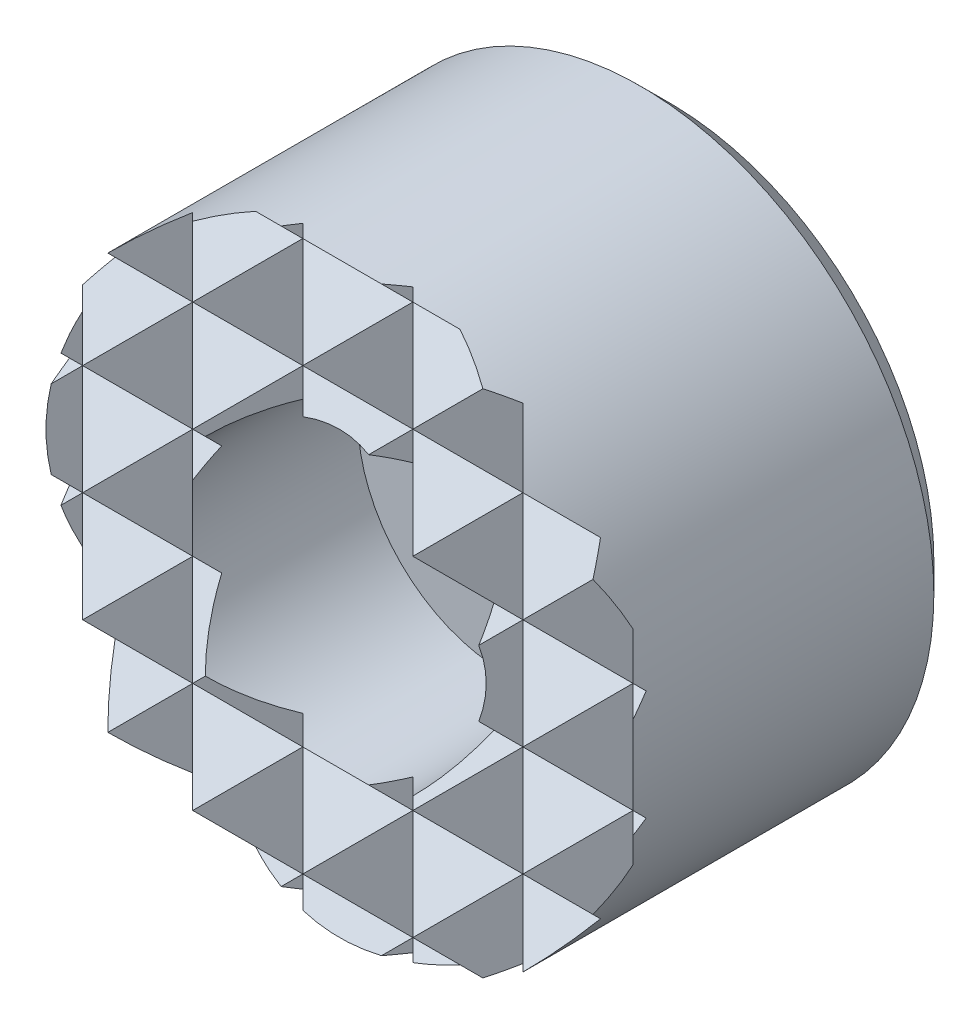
ISO-10303-21;
HEADER;
FILE_DESCRIPTION(('STEP AP214'),'2;1');
FILE_NAME('part.step','',(''),(''),'','','');
FILE_SCHEMA(('AUTOMOTIVE_DESIGN { 1 0 10303 214 1 1 1 1 }'));
ENDSEC;
DATA;
#1=APPLICATION_CONTEXT('core data for automotive mechanical design processes');
#2=APPLICATION_PROTOCOL_DEFINITION('international standard','automotive_design',2000,#1);
#3=PRODUCT_CONTEXT('',#1,'mechanical');
#4=PRODUCT('Part','Part','',(#3));
#5=PRODUCT_RELATED_PRODUCT_CATEGORY('part','',(#4));
#6=PRODUCT_DEFINITION_FORMATION('','',#4);
#7=PRODUCT_DEFINITION_CONTEXT('part definition',#1,'design');
#8=PRODUCT_DEFINITION('design','',#6,#7);
#9=PRODUCT_DEFINITION_SHAPE('','',#8);
#10=(LENGTH_UNIT() NAMED_UNIT(*) SI_UNIT(.MILLI.,.METRE.));
#11=(NAMED_UNIT(*) PLANE_ANGLE_UNIT() SI_UNIT($,.RADIAN.));
#12=(NAMED_UNIT(*) SI_UNIT($,.STERADIAN.) SOLID_ANGLE_UNIT());
#13=UNCERTAINTY_MEASURE_WITH_UNIT(LENGTH_MEASURE(1.E-05),#10,'distance_accuracy_value','');
#14=(GEOMETRIC_REPRESENTATION_CONTEXT(3) GLOBAL_UNCERTAINTY_ASSIGNED_CONTEXT((#13)) GLOBAL_UNIT_ASSIGNED_CONTEXT((#10,
#11,#12)) REPRESENTATION_CONTEXT('',''));
#15=CARTESIAN_POINT('',(0.,0.,0.));
#16=DIRECTION('',(0.,0.,1.));
#17=DIRECTION('',(1.,0.,0.));
#18=AXIS2_PLACEMENT_3D('',#15,#16,#17);
#19=CARTESIAN_POINT('',(4.5,-10.,8.5));
#20=DIRECTION('',(0.707106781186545,0.,-0.70710678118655));
#21=DIRECTION('',(-0.70710678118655,0.,-0.707106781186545));
#22=AXIS2_PLACEMENT_3D('',#19,#20,#21);
#23=PLANE('',#22);
#24=CARTESIAN_POINT('',(0.,0.,4.));
#25=DIRECTION('',(0.707106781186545,0.,-0.70710678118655));
#26=DIRECTION('',(-0.70710678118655,0.,-0.707106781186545));
#27=AXIS2_PLACEMENT_3D('',#24,#25,#26);
#28=ELLIPSE('',#27,11.3137084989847,8.);
#29=CARTESIAN_POINT('',(5.65685424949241,-5.65685424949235,9.65685424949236));
#30=VERTEX_POINT('',#29);
#31=CARTESIAN_POINT('',(4.5,-6.61437827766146,8.5));
#32=VERTEX_POINT('',#31);
#33=EDGE_CURVE('E771',#30,#32,#28,.T.);
#34=ORIENTED_EDGE('',*,*,#33,.F.);
#35=DIRECTION('',(-0.577350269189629,0.577350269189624,-0.577350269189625));
#36=VECTOR('',#35,1.);
#37=CARTESIAN_POINT('',(6.33333333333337,-6.33333333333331,10.3333333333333));
#38=LINE('',#37,#36);
#39=CARTESIAN_POINT('',(4.5,-4.5,8.5));
#40=VERTEX_POINT('',#39);
#41=EDGE_CURVE('E524',#30,#40,#38,.T.);
#42=ORIENTED_EDGE('',*,*,#41,.T.);
#43=DIRECTION('',(0.,1.,0.));
#44=VECTOR('',#43,1.);
#45=CARTESIAN_POINT('',(4.5,-10.,8.5));
#46=LINE('',#45,#44);
#47=EDGE_CURVE('E672',#32,#40,#46,.T.);
#48=ORIENTED_EDGE('',*,*,#47,.F.);
#49=EDGE_LOOP('',(#34,#42,#48));
#50=FACE_BOUND('',#49,.T.);
#51=ADVANCED_FACE('F15',(#50),#23,.F.);
#52=CARTESIAN_POINT('',(4.5,-1.5,8.5));
#53=VERTEX_POINT('',#52);
#54=CARTESIAN_POINT('',(4.5,1.5,8.5));
#55=VERTEX_POINT('',#54);
#56=EDGE_CURVE('E1041',#53,#55,#46,.T.);
#57=ORIENTED_EDGE('',*,*,#56,.F.);
#58=DIRECTION('',(0.577350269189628,0.577350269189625,0.577350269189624));
#59=VECTOR('',#58,1.);
#60=CARTESIAN_POINT('',(1.66666666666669,-4.33333333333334,5.66666666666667));
#61=LINE('',#60,#59);
#62=CARTESIAN_POINT('',(6.,0.,10.));
#63=VERTEX_POINT('',#62);
#64=EDGE_CURVE('E637',#53,#63,#61,.T.);
#65=ORIENTED_EDGE('',*,*,#64,.T.);
#66=DIRECTION('',(-0.577350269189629,0.577350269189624,-0.577350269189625));
#67=VECTOR('',#66,1.);
#68=CARTESIAN_POINT('',(8.33333333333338,-2.33333333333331,12.3333333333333));
#69=LINE('',#68,#67);
#70=EDGE_CURVE('E663',#63,#55,#69,.T.);
#71=ORIENTED_EDGE('',*,*,#70,.T.);
#72=EDGE_LOOP('',(#57,#65,#71));
#73=FACE_BOUND('',#72,.T.);
#74=ADVANCED_FACE('F1001',(#73),#23,.F.);
#75=CARTESIAN_POINT('',(4.5,4.5,8.5));
#76=VERTEX_POINT('',#75);
#77=CARTESIAN_POINT('',(4.5,6.61437827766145,8.5));
#78=VERTEX_POINT('',#77);
#79=EDGE_CURVE('E676',#76,#78,#46,.T.);
#80=ORIENTED_EDGE('',*,*,#79,.F.);
#81=DIRECTION('',(0.577350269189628,0.577350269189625,0.577350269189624));
#82=VECTOR('',#81,1.);
#83=CARTESIAN_POINT('',(-0.333333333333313,-0.333333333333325,3.66666666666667));
#84=LINE('',#83,#82);
#85=CARTESIAN_POINT('',(5.6568542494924,5.65685424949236,9.65685424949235));
#86=VERTEX_POINT('',#85);
#87=EDGE_CURVE('E433',#76,#86,#84,.T.);
#88=ORIENTED_EDGE('',*,*,#87,.T.);
#89=EDGE_CURVE('E767',#78,#86,#28,.T.);
#90=ORIENTED_EDGE('',*,*,#89,.F.);
#91=EDGE_LOOP('',(#80,#88,#90));
#92=FACE_BOUND('',#91,.T.);
#93=ADVANCED_FACE('F1009',(#92),#23,.F.);
#94=CARTESIAN_POINT('',(6.,-10.,10.));
#95=DIRECTION('',(-0.70710678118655,0.,-0.707106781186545));
#96=DIRECTION('',(-0.707106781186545,0.,0.70710678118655));
#97=AXIS2_PLACEMENT_3D('',#94,#95,#96);
#98=PLANE('',#97);
#99=DIRECTION('',(-0.577350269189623,-0.577350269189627,0.577350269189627));
#100=VECTOR('',#99,1.);
#101=CARTESIAN_POINT('',(3.6666666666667,-5.33333333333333,12.3333333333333));
#102=LINE('',#101,#100);
#103=CARTESIAN_POINT('',(7.5,-1.5,8.5));
#104=VERTEX_POINT('',#103);
#105=CARTESIAN_POINT('',(6.,-3.,10.));
#106=VERTEX_POINT('',#105);
#107=EDGE_CURVE('E612',#104,#106,#102,.T.);
#108=ORIENTED_EDGE('',*,*,#107,.T.);
#109=DIRECTION('',(0.577350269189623,-0.577350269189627,-0.577350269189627));
#110=VECTOR('',#109,1.);
#111=CARTESIAN_POINT('',(8.33333333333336,-5.33333333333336,7.66666666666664));
#112=LINE('',#111,#110);
#113=CARTESIAN_POINT('',(6.95435605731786,-3.95435605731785,9.04564394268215));
#114=VERTEX_POINT('',#113);
#115=EDGE_CURVE('E556',#106,#114,#112,.T.);
#116=ORIENTED_EDGE('',*,*,#115,.T.);
#117=CARTESIAN_POINT('',(0.,0.,16.));
#118=DIRECTION('',(-0.70710678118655,0.,-0.707106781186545));
#119=DIRECTION('',(0.707106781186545,0.,-0.70710678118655));
#120=AXIS2_PLACEMENT_3D('',#117,#118,#119);
#121=ELLIPSE('',#120,11.3137084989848,8.);
#122=CARTESIAN_POINT('',(7.5,-2.78388218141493,8.5));
#123=VERTEX_POINT('',#122);
#124=EDGE_CURVE('E774',#123,#114,#121,.T.);
#125=ORIENTED_EDGE('',*,*,#124,.F.);
#126=DIRECTION('',(0.,1.,0.));
#127=VECTOR('',#126,1.);
#128=CARTESIAN_POINT('',(7.5,-10.,8.5));
#129=LINE('',#128,#127);
#130=EDGE_CURVE('E677',#123,#104,#129,.T.);
#131=ORIENTED_EDGE('',*,*,#130,.T.);
#132=EDGE_LOOP('',(#108,#116,#125,#131));
#133=FACE_BOUND('',#132,.T.);
#134=ADVANCED_FACE('F877',(#133),#98,.F.);
#135=DIRECTION('',(-0.577350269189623,-0.577350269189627,0.577350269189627));
#136=VECTOR('',#135,1.);
#137=CARTESIAN_POINT('',(2.6666666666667,-3.33333333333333,13.3333333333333));
#138=LINE('',#137,#136);
#139=CARTESIAN_POINT('',(7.5,1.5,8.5));
#140=VERTEX_POINT('',#139);
#141=EDGE_CURVE('E666',#140,#63,#138,.T.);
#142=ORIENTED_EDGE('',*,*,#141,.T.);
#143=DIRECTION('',(0.577350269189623,-0.577350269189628,-0.577350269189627));
#144=VECTOR('',#143,1.);
#145=CARTESIAN_POINT('',(9.33333333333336,-3.33333333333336,6.66666666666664));
#146=LINE('',#145,#144);
#147=EDGE_CURVE('E30',#63,#104,#146,.T.);
#148=ORIENTED_EDGE('',*,*,#147,.T.);
#149=EDGE_CURVE('E680',#104,#140,#129,.T.);
#150=ORIENTED_EDGE('',*,*,#149,.T.);
#151=EDGE_LOOP('',(#142,#148,#150));
#152=FACE_BOUND('',#151,.T.);
#153=ADVANCED_FACE('F883',(#152),#98,.F.);
#154=CARTESIAN_POINT('',(7.5,-10.,8.5));
#155=DIRECTION('',(0.707106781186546,0.,-0.707106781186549));
#156=DIRECTION('',(-0.707106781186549,0.,-0.707106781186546));
#157=AXIS2_PLACEMENT_3D('',#154,#155,#156);
#158=PLANE('',#157);
#159=CARTESIAN_POINT('',(7.5,2.78388218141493,8.5));
#160=VERTEX_POINT('',#159);
#161=EDGE_CURVE('E681',#140,#160,#129,.T.);
#162=ORIENTED_EDGE('',*,*,#161,.F.);
#163=DIRECTION('',(0.577350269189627,0.577350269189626,0.577350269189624));
#164=VECTOR('',#163,1.);
#165=CARTESIAN_POINT('',(3.66666666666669,-2.33333333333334,4.66666666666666));
#166=LINE('',#165,#164);
#167=CARTESIAN_POINT('',(7.79583152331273,1.79583152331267,8.79583152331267));
#168=VERTEX_POINT('',#167);
#169=EDGE_CURVE('E581',#140,#168,#166,.T.);
#170=ORIENTED_EDGE('',*,*,#169,.T.);
#171=CARTESIAN_POINT('',(0.,0.,0.999999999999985));
#172=DIRECTION('',(0.707106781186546,0.,-0.707106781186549));
#173=DIRECTION('',(-0.707106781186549,0.,-0.707106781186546));
#174=AXIS2_PLACEMENT_3D('',#171,#172,#173);
#175=ELLIPSE('',#174,11.3137084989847,8.);
#176=EDGE_CURVE('E775',#160,#168,#175,.T.);
#177=ORIENTED_EDGE('',*,*,#176,.F.);
#178=EDGE_LOOP('',(#162,#170,#177));
#179=FACE_BOUND('',#178,.T.);
#180=ADVANCED_FACE('F892',(#179),#158,.F.);
#181=CARTESIAN_POINT('',(7.92782730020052,1.07217269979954,8.92782730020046));
#182=VERTEX_POINT('',#181);
#183=CARTESIAN_POINT('',(7.92782730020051,-1.07217269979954,8.92782730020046));
#184=VERTEX_POINT('',#183);
#185=EDGE_CURVE('E778',#182,#184,#175,.T.);
#186=ORIENTED_EDGE('',*,*,#185,.F.);
#187=DIRECTION('',(-0.577350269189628,0.577350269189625,-0.577350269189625));
#188=VECTOR('',#187,1.);
#189=CARTESIAN_POINT('',(11.3333333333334,-2.3333333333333,12.3333333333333));
#190=LINE('',#189,#188);
#191=EDGE_CURVE('E669',#182,#140,#190,.T.);
#192=ORIENTED_EDGE('',*,*,#191,.T.);
#193=ORIENTED_EDGE('',*,*,#149,.F.);
#194=DIRECTION('',(0.577350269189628,0.577350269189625,0.577350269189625));
#195=VECTOR('',#194,1.);
#196=CARTESIAN_POINT('',(4.6666666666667,-4.33333333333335,5.66666666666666));
#197=LINE('',#196,#195);
#198=EDGE_CURVE('E641',#104,#184,#197,.T.);
#199=ORIENTED_EDGE('',*,*,#198,.T.);
#200=EDGE_LOOP('',(#186,#192,#193,#199));
#201=FACE_BOUND('',#200,.T.);
#202=ADVANCED_FACE('F866',(#201),#158,.F.);
#203=CARTESIAN_POINT('',(-9.,-10.,10.));
#204=DIRECTION('',(-0.70710678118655,0.,-0.707106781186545));
#205=DIRECTION('',(-0.707106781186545,0.,0.70710678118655));
#206=AXIS2_PLACEMENT_3D('',#203,#204,#205);
#207=PLANE('',#206);
#208=CARTESIAN_POINT('',(0.,0.,1.));
#209=DIRECTION('',(-0.70710678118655,0.,-0.707106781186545));
#210=DIRECTION('',(0.707106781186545,0.,-0.70710678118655));
#211=AXIS2_PLACEMENT_3D('',#208,#209,#210);
#212=ELLIPSE('',#211,11.3137084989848,8.);
#213=CARTESIAN_POINT('',(-7.79583152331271,1.79583152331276,8.79583152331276));
#214=VERTEX_POINT('',#213);
#215=CARTESIAN_POINT('',(-7.5,2.78388218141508,8.5));
#216=VERTEX_POINT('',#215);
#217=EDGE_CURVE('E761',#214,#216,#212,.T.);
#218=ORIENTED_EDGE('',*,*,#217,.F.);
#219=DIRECTION('',(0.577350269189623,-0.577350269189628,-0.577350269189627));
#220=VECTOR('',#219,1.);
#221=CARTESIAN_POINT('',(-4.66666666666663,-1.33333333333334,5.66666666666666));
#222=LINE('',#221,#220);
#223=CARTESIAN_POINT('',(-7.5,1.5,8.5));
#224=VERTEX_POINT('',#223);
#225=EDGE_CURVE('E392',#214,#224,#222,.T.);
#226=ORIENTED_EDGE('',*,*,#225,.T.);
#227=DIRECTION('',(0.,1.,0.));
#228=VECTOR('',#227,1.);
#229=CARTESIAN_POINT('',(-7.5,-10.,8.5));
#230=LINE('',#229,#228);
#231=EDGE_CURVE('E390',#224,#216,#230,.T.);
#232=ORIENTED_EDGE('',*,*,#231,.T.);
#233=EDGE_LOOP('',(#218,#226,#232));
#234=FACE_BOUND('',#233,.T.);
#235=ADVANCED_FACE('F1885',(#234),#207,.F.);
#236=CARTESIAN_POINT('',(-7.5,-1.5,8.5));
#237=VERTEX_POINT('',#236);
#238=EDGE_CURVE('E685',#237,#224,#230,.T.);
#239=ORIENTED_EDGE('',*,*,#238,.T.);
#240=DIRECTION('',(-0.577350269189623,-0.577350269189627,0.577350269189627));
#241=VECTOR('',#240,1.);
#242=CARTESIAN_POINT('',(-12.3333333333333,-3.33333333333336,13.3333333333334));
#243=LINE('',#242,#241);
#244=CARTESIAN_POINT('',(-7.92782730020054,1.07217269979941,8.92782730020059));
#245=VERTEX_POINT('',#244);
#246=EDGE_CURVE('E650',#224,#245,#243,.T.);
#247=ORIENTED_EDGE('',*,*,#246,.T.);
#248=CARTESIAN_POINT('',(-7.92782730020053,-1.07217269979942,8.92782730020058));
#249=VERTEX_POINT('',#248);
#250=EDGE_CURVE('E766',#249,#245,#212,.T.);
#251=ORIENTED_EDGE('',*,*,#250,.F.);
#252=DIRECTION('',(0.577350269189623,-0.577350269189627,-0.577350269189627));
#253=VECTOR('',#252,1.);
#254=CARTESIAN_POINT('',(-5.66666666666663,-3.33333333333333,6.66666666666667));
#255=LINE('',#254,#253);
#256=EDGE_CURVE('E624',#249,#237,#255,.T.);
#257=ORIENTED_EDGE('',*,*,#256,.T.);
#258=EDGE_LOOP('',(#239,#247,#251,#257));
#259=FACE_BOUND('',#258,.T.);
#260=ADVANCED_FACE('F1890',(#259),#207,.F.);
#261=CARTESIAN_POINT('',(-7.5,-10.,8.5));
#262=DIRECTION('',(0.707106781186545,0.,-0.70710678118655));
#263=DIRECTION('',(-0.70710678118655,0.,-0.707106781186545));
#264=AXIS2_PLACEMENT_3D('',#261,#262,#263);
#265=PLANE('',#264);
#266=CARTESIAN_POINT('',(0.,0.,16.));
#267=DIRECTION('',(0.707106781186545,0.,-0.70710678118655));
#268=DIRECTION('',(-0.70710678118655,0.,-0.707106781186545));
#269=AXIS2_PLACEMENT_3D('',#266,#267,#268);
#270=ELLIPSE('',#269,11.3137084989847,8.);
#271=CARTESIAN_POINT('',(-6.95435605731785,-3.95435605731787,9.04564394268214));
#272=VERTEX_POINT('',#271);
#273=CARTESIAN_POINT('',(-7.5,-2.78388218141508,8.5));
#274=VERTEX_POINT('',#273);
#275=EDGE_CURVE('E762',#272,#274,#270,.T.);
#276=ORIENTED_EDGE('',*,*,#275,.F.);
#277=DIRECTION('',(0.577350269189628,0.577350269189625,0.577350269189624));
#278=VECTOR('',#277,1.);
#279=CARTESIAN_POINT('',(-9.33333333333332,-6.33333333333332,6.66666666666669));
#280=LINE('',#279,#278);
#281=CARTESIAN_POINT('',(-6.,-3.,10.));
#282=VERTEX_POINT('',#281);
#283=EDGE_CURVE('E547',#272,#282,#280,.T.);
#284=ORIENTED_EDGE('',*,*,#283,.T.);
#285=DIRECTION('',(-0.577350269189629,0.577350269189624,-0.577350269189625));
#286=VECTOR('',#285,1.);
#287=CARTESIAN_POINT('',(-4.66666666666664,-4.33333333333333,11.3333333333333));
#288=LINE('',#287,#286);
#289=EDGE_CURVE('E590',#282,#237,#288,.T.);
#290=ORIENTED_EDGE('',*,*,#289,.T.);
#291=EDGE_CURVE('E682',#274,#237,#230,.T.);
#292=ORIENTED_EDGE('',*,*,#291,.F.);
#293=EDGE_LOOP('',(#276,#284,#290,#292));
#294=FACE_BOUND('',#293,.T.);
#295=ADVANCED_FACE('F1367',(#294),#265,.F.);
#296=ORIENTED_EDGE('',*,*,#238,.F.);
#297=DIRECTION('',(0.577350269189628,0.577350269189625,0.577350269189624));
#298=VECTOR('',#297,1.);
#299=CARTESIAN_POINT('',(-10.3333333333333,-4.33333333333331,5.66666666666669));
#300=LINE('',#299,#298);
#301=CARTESIAN_POINT('',(-6.,0.,10.));
#302=VERTEX_POINT('',#301);
#303=EDGE_CURVE('E621',#237,#302,#300,.T.);
#304=ORIENTED_EDGE('',*,*,#303,.T.);
#305=DIRECTION('',(-0.577350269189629,0.577350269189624,-0.577350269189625));
#306=VECTOR('',#305,1.);
#307=CARTESIAN_POINT('',(-3.66666666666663,-2.33333333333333,12.3333333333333));
#308=LINE('',#307,#306);
#309=EDGE_CURVE('E647',#302,#224,#308,.T.);
#310=ORIENTED_EDGE('',*,*,#309,.T.);
#311=EDGE_LOOP('',(#296,#304,#310));
#312=FACE_BOUND('',#311,.T.);
#313=ADVANCED_FACE('F2011',(#312),#265,.F.);
#314=CARTESIAN_POINT('',(-6.,-10.,10.));
#315=DIRECTION('',(-0.70710678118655,0.,-0.707106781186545));
#316=DIRECTION('',(-0.707106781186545,0.,0.70710678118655));
#317=AXIS2_PLACEMENT_3D('',#314,#315,#316);
#318=PLANE('',#317);
#319=DIRECTION('',(0.,1.,0.));
#320=VECTOR('',#319,1.);
#321=CARTESIAN_POINT('',(-4.5,-10.,8.5));
#322=LINE('',#321,#320);
#323=CARTESIAN_POINT('',(-4.5,-6.6143782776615,8.5));
#324=VERTEX_POINT('',#323);
#325=CARTESIAN_POINT('',(-4.5,-4.5,8.5));
#326=VERTEX_POINT('',#325);
#327=EDGE_CURVE('E686',#324,#326,#322,.T.);
#328=ORIENTED_EDGE('',*,*,#327,.T.);
#329=DIRECTION('',(-0.577350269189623,-0.577350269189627,0.577350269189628));
#330=VECTOR('',#329,1.);
#331=CARTESIAN_POINT('',(-7.33333333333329,-7.33333333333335,11.3333333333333));
#332=LINE('',#331,#330);
#333=CARTESIAN_POINT('',(-5.65685424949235,-5.6568542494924,9.65685424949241));
#334=VERTEX_POINT('',#333);
#335=EDGE_CURVE('E514',#326,#334,#332,.T.);
#336=ORIENTED_EDGE('',*,*,#335,.T.);
#337=CARTESIAN_POINT('',(0.,0.,4.));
#338=DIRECTION('',(-0.70710678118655,0.,-0.707106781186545));
#339=DIRECTION('',(0.707106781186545,0.,-0.70710678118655));
#340=AXIS2_PLACEMENT_3D('',#337,#338,#339);
#341=ELLIPSE('',#340,11.3137084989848,8.);
#342=EDGE_CURVE('E759',#324,#334,#341,.T.);
#343=ORIENTED_EDGE('',*,*,#342,.F.);
#344=EDGE_LOOP('',(#328,#336,#343));
#345=FACE_BOUND('',#344,.T.);
#346=ADVANCED_FACE('F1374',(#345),#318,.F.);
#347=DIRECTION('',(-0.577350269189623,-0.577350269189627,0.577350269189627));
#348=VECTOR('',#347,1.);
#349=CARTESIAN_POINT('',(-9.33333333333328,-3.33333333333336,13.3333333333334));
#350=LINE('',#349,#348);
#351=CARTESIAN_POINT('',(-4.5,1.5,8.5));
#352=VERTEX_POINT('',#351);
#353=EDGE_CURVE('E644',#352,#302,#350,.T.);
#354=ORIENTED_EDGE('',*,*,#353,.T.);
#355=DIRECTION('',(0.577350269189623,-0.577350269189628,-0.577350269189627));
#356=VECTOR('',#355,1.);
#357=CARTESIAN_POINT('',(-2.66666666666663,-3.33333333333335,6.66666666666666));
#358=LINE('',#357,#356);
#359=CARTESIAN_POINT('',(-4.5,-1.5,8.5));
#360=VERTEX_POINT('',#359);
#361=EDGE_CURVE('E618',#302,#360,#358,.T.);
#362=ORIENTED_EDGE('',*,*,#361,.T.);
#363=EDGE_CURVE('E809',#360,#352,#322,.T.);
#364=ORIENTED_EDGE('',*,*,#363,.T.);
#365=EDGE_LOOP('',(#354,#362,#364));
#366=FACE_BOUND('',#365,.T.);
#367=ADVANCED_FACE('F815',(#366),#318,.F.);
#368=CARTESIAN_POINT('',(-5.65685424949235,5.65685424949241,9.6568542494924));
#369=VERTEX_POINT('',#368);
#370=CARTESIAN_POINT('',(-4.5,6.6143782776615,8.5));
#371=VERTEX_POINT('',#370);
#372=EDGE_CURVE('E756',#369,#371,#341,.T.);
#373=ORIENTED_EDGE('',*,*,#372,.F.);
#374=DIRECTION('',(0.577350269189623,-0.577350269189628,-0.577350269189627));
#375=VECTOR('',#374,1.);
#376=CARTESIAN_POINT('',(-0.666666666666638,0.666666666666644,4.66666666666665));
#377=LINE('',#376,#375);
#378=CARTESIAN_POINT('',(-4.5,4.5,8.5));
#379=VERTEX_POINT('',#378);
#380=EDGE_CURVE('E423',#369,#379,#377,.T.);
#381=ORIENTED_EDGE('',*,*,#380,.T.);
#382=EDGE_CURVE('E690',#379,#371,#322,.T.);
#383=ORIENTED_EDGE('',*,*,#382,.T.);
#384=EDGE_LOOP('',(#373,#381,#383));
#385=FACE_BOUND('',#384,.T.);
#386=ADVANCED_FACE('F1171',(#385),#318,.F.);
#387=CARTESIAN_POINT('',(1.50000000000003,-10.,8.5));
#388=DIRECTION('',(0.707106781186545,0.,-0.70710678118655));
#389=DIRECTION('',(-0.70710678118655,0.,-0.707106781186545));
#390=AXIS2_PLACEMENT_3D('',#387,#388,#389);
#391=PLANE('',#390);
#392=DIRECTION('',(0.,1.,0.));
#393=VECTOR('',#392,1.);
#394=CARTESIAN_POINT('',(1.50000000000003,-10.,8.5));
#395=LINE('',#394,#393);
#396=CARTESIAN_POINT('',(1.50000000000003,7.5,8.5));
#397=VERTEX_POINT('',#396);
#398=CARTESIAN_POINT('',(1.50000000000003,7.85811682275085,8.5));
#399=VERTEX_POINT('',#398);
#400=EDGE_CURVE('E848',#397,#399,#395,.T.);
#401=ORIENTED_EDGE('',*,*,#400,.F.);
#402=DIRECTION('',(0.577350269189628,0.577350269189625,0.577350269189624));
#403=VECTOR('',#402,1.);
#404=CARTESIAN_POINT('',(-4.33333333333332,1.66666666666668,2.66666666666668));
#405=LINE('',#404,#403);
#406=CARTESIAN_POINT('',(1.79583152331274,7.79583152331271,8.79583152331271));
#407=VERTEX_POINT('',#406);
#408=EDGE_CURVE('E455',#397,#407,#405,.T.);
#409=ORIENTED_EDGE('',*,*,#408,.T.);
#410=CARTESIAN_POINT('',(0.,0.,7.));
#411=DIRECTION('',(0.707106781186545,0.,-0.70710678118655));
#412=DIRECTION('',(-0.70710678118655,0.,-0.707106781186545));
#413=AXIS2_PLACEMENT_3D('',#410,#411,#412);
#414=ELLIPSE('',#413,11.3137084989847,8.);
#415=EDGE_CURVE('E719',#399,#407,#414,.T.);
#416=ORIENTED_EDGE('',*,*,#415,.F.);
#417=EDGE_LOOP('',(#401,#409,#416));
#418=FACE_BOUND('',#417,.T.);
#419=ADVANCED_FACE('F962',(#418),#391,.F.);
#420=DIRECTION('',(0.577350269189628,0.577350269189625,0.577350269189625));
#421=VECTOR('',#420,1.);
#422=CARTESIAN_POINT('',(-0.333333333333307,-6.33333333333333,6.66666666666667));
#423=LINE('',#422,#421);
#424=CARTESIAN_POINT('',(1.50000000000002,-4.5,8.5));
#425=VERTEX_POINT('',#424);
#426=CARTESIAN_POINT('',(3.,-3.,10.));
#427=VERTEX_POINT('',#426);
#428=EDGE_CURVE('E527',#425,#427,#423,.T.);
#429=ORIENTED_EDGE('',*,*,#428,.T.);
#430=DIRECTION('',(-0.577350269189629,0.577350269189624,-0.577350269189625));
#431=VECTOR('',#430,1.);
#432=CARTESIAN_POINT('',(4.33333333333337,-4.33333333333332,11.3333333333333));
#433=LINE('',#432,#431);
#434=CARTESIAN_POINT('',(2.82842712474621,-2.82842712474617,9.82842712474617));
#435=VERTEX_POINT('',#434);
#436=EDGE_CURVE('E606',#427,#435,#433,.T.);
#437=ORIENTED_EDGE('',*,*,#436,.T.);
#438=CARTESIAN_POINT('',(0.,0.,7.));
#439=DIRECTION('',(0.707106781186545,0.,-0.70710678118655));
#440=DIRECTION('',(0.70710678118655,0.,0.707106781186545));
#441=AXIS2_PLACEMENT_3D('',#438,#439,#440);
#442=ELLIPSE('',#441,5.65685424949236,4.);
#443=CARTESIAN_POINT('',(1.50000000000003,-3.70809924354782,8.5));
#444=VERTEX_POINT('',#443);
#445=EDGE_CURVE('E750',#435,#444,#442,.T.);
#446=ORIENTED_EDGE('',*,*,#445,.T.);
#447=EDGE_CURVE('E700',#425,#444,#395,.T.);
#448=ORIENTED_EDGE('',*,*,#447,.F.);
#449=EDGE_LOOP('',(#429,#437,#446,#448));
#450=FACE_BOUND('',#449,.T.);
#451=ADVANCED_FACE('F1145',(#450),#391,.F.);
#452=CARTESIAN_POINT('',(3.00000000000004,-10.,10.));
#453=DIRECTION('',(-0.707106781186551,0.,-0.707106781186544));
#454=DIRECTION('',(-0.707106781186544,0.,0.707106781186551));
#455=AXIS2_PLACEMENT_3D('',#452,#453,#454);
#456=PLANE('',#455);
#457=CARTESIAN_POINT('',(0.,0.,13.));
#458=DIRECTION('',(-0.707106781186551,0.,-0.707106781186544));
#459=DIRECTION('',(-0.707106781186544,0.,0.707106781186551));
#460=AXIS2_PLACEMENT_3D('',#457,#458,#459);
#461=ELLIPSE('',#460,5.65685424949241,4.);
#462=CARTESIAN_POINT('',(3.89791576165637,0.897915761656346,9.10208423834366));
#463=VERTEX_POINT('',#462);
#464=CARTESIAN_POINT('',(3.89791576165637,-0.897915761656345,9.10208423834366));
#465=VERTEX_POINT('',#464);
#466=EDGE_CURVE('E753',#463,#465,#461,.T.);
#467=ORIENTED_EDGE('',*,*,#466,.T.);
#468=DIRECTION('',(0.577350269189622,-0.577350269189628,-0.577350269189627));
#469=VECTOR('',#468,1.);
#470=CARTESIAN_POINT('',(6.33333333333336,-3.33333333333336,6.66666666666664));
#471=LINE('',#470,#469);
#472=EDGE_CURVE('E633',#465,#53,#471,.T.);
#473=ORIENTED_EDGE('',*,*,#472,.T.);
#474=ORIENTED_EDGE('',*,*,#56,.T.);
#475=DIRECTION('',(-0.577350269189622,-0.577350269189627,0.577350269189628));
#476=VECTOR('',#475,1.);
#477=CARTESIAN_POINT('',(-0.333333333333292,-3.33333333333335,13.3333333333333));
#478=LINE('',#477,#476);
#479=EDGE_CURVE('E659',#55,#463,#478,.T.);
#480=ORIENTED_EDGE('',*,*,#479,.T.);
#481=EDGE_LOOP('',(#467,#473,#474,#480));
#482=FACE_BOUND('',#481,.T.);
#483=ADVANCED_FACE('F1026',(#482),#456,.F.);
#484=ORIENTED_EDGE('',*,*,#47,.T.);
#485=DIRECTION('',(-0.577350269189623,-0.577350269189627,0.577350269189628));
#486=VECTOR('',#485,1.);
#487=CARTESIAN_POINT('',(1.6666666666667,-7.33333333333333,11.3333333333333));
#488=LINE('',#487,#486);
#489=CARTESIAN_POINT('',(3.,-6.,10.));
#490=VERTEX_POINT('',#489);
#491=EDGE_CURVE('E520',#40,#490,#488,.T.);
#492=ORIENTED_EDGE('',*,*,#491,.T.);
#493=DIRECTION('',(0.577350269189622,-0.577350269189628,-0.577350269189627));
#494=VECTOR('',#493,1.);
#495=CARTESIAN_POINT('',(4.33333333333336,-7.33333333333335,8.66666666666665));
#496=LINE('',#495,#494);
#497=CARTESIAN_POINT('',(3.95435605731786,-6.95435605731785,9.04564394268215));
#498=VERTEX_POINT('',#497);
#499=EDGE_CURVE('E498',#490,#498,#496,.T.);
#500=ORIENTED_EDGE('',*,*,#499,.T.);
#501=CARTESIAN_POINT('',(0.,0.,13.));
#502=DIRECTION('',(-0.707106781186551,0.,-0.707106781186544));
#503=DIRECTION('',(0.707106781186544,0.,-0.707106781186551));
#504=AXIS2_PLACEMENT_3D('',#501,#502,#503);
#505=ELLIPSE('',#504,11.3137084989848,8.);
#506=EDGE_CURVE('E716',#32,#498,#505,.T.);
#507=ORIENTED_EDGE('',*,*,#506,.F.);
#508=EDGE_LOOP('',(#484,#492,#500,#507));
#509=FACE_BOUND('',#508,.T.);
#510=ADVANCED_FACE('F1085',(#509),#456,.F.);
#511=CARTESIAN_POINT('',(3.95435605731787,6.95435605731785,9.04564394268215));
#512=VERTEX_POINT('',#511);
#513=EDGE_CURVE('E714',#512,#78,#505,.T.);
#514=ORIENTED_EDGE('',*,*,#513,.F.);
#515=DIRECTION('',(-0.577350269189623,-0.577350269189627,0.577350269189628));
#516=VECTOR('',#515,1.);
#517=CARTESIAN_POINT('',(-2.33333333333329,0.666666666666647,15.3333333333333));
#518=LINE('',#517,#516);
#519=CARTESIAN_POINT('',(3.,6.,10.));
#520=VERTEX_POINT('',#519);
#521=EDGE_CURVE('E451',#512,#520,#518,.T.);
#522=ORIENTED_EDGE('',*,*,#521,.T.);
#523=DIRECTION('',(0.577350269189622,-0.577350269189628,-0.577350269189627));
#524=VECTOR('',#523,1.);
#525=CARTESIAN_POINT('',(8.33333333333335,0.666666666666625,4.66666666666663));
#526=LINE('',#525,#524);
#527=EDGE_CURVE('E429',#520,#76,#526,.T.);
#528=ORIENTED_EDGE('',*,*,#527,.T.);
#529=ORIENTED_EDGE('',*,*,#79,.T.);
#530=EDGE_LOOP('',(#514,#522,#528,#529));
#531=FACE_BOUND('',#530,.T.);
#532=ADVANCED_FACE('F1027',(#531),#456,.F.);
#533=CARTESIAN_POINT('',(-4.5,-10.,8.5));
#534=DIRECTION('',(0.707106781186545,0.,-0.70710678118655));
#535=DIRECTION('',(-0.70710678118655,0.,-0.707106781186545));
#536=AXIS2_PLACEMENT_3D('',#533,#534,#535);
#537=PLANE('',#536);
#538=ORIENTED_EDGE('',*,*,#363,.F.);
#539=DIRECTION('',(0.577350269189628,0.577350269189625,0.577350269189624));
#540=VECTOR('',#539,1.);
#541=CARTESIAN_POINT('',(-7.33333333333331,-4.33333333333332,5.66666666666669));
#542=LINE('',#541,#540);
#543=CARTESIAN_POINT('',(-3.89791576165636,-0.897915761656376,9.10208423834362));
#544=VERTEX_POINT('',#543);
#545=EDGE_CURVE('E9',#360,#544,#542,.T.);
#546=ORIENTED_EDGE('',*,*,#545,.T.);
#547=CARTESIAN_POINT('',(0.,0.,13.));
#548=DIRECTION('',(0.707106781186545,0.,-0.70710678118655));
#549=DIRECTION('',(0.70710678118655,0.,0.707106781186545));
#550=AXIS2_PLACEMENT_3D('',#547,#548,#549);
#551=ELLIPSE('',#550,5.65685424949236,4.);
#552=CARTESIAN_POINT('',(-3.89791576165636,0.897915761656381,9.10208423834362));
#553=VERTEX_POINT('',#552);
#554=EDGE_CURVE('E746',#544,#553,#551,.T.);
#555=ORIENTED_EDGE('',*,*,#554,.T.);
#556=DIRECTION('',(-0.577350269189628,0.577350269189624,-0.577350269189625));
#557=VECTOR('',#556,1.);
#558=CARTESIAN_POINT('',(-0.666666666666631,-2.33333333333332,12.3333333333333));
#559=LINE('',#558,#557);
#560=EDGE_CURVE('E23',#553,#352,#559,.T.);
#561=ORIENTED_EDGE('',*,*,#560,.T.);
#562=EDGE_LOOP('',(#538,#546,#555,#561));
#563=FACE_BOUND('',#562,.T.);
#564=ADVANCED_FACE('F808',(#563),#537,.F.);
#565=DIRECTION('',(0.577350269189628,0.577350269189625,0.577350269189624));
#566=VECTOR('',#565,1.);
#567=CARTESIAN_POINT('',(-5.33333333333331,-8.33333333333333,7.66666666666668));
#568=LINE('',#567,#566);
#569=CARTESIAN_POINT('',(-3.95435605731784,-6.95435605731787,9.04564394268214));
#570=VERTEX_POINT('',#569);
#571=CARTESIAN_POINT('',(-2.99999999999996,-6.,10.));
#572=VERTEX_POINT('',#571);
#573=EDGE_CURVE('E489',#570,#572,#568,.T.);
#574=ORIENTED_EDGE('',*,*,#573,.T.);
#575=DIRECTION('',(-0.577350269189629,0.577350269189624,-0.577350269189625));
#576=VECTOR('',#575,1.);
#577=CARTESIAN_POINT('',(-2.66666666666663,-6.33333333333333,10.3333333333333));
#578=LINE('',#577,#576);
#579=EDGE_CURVE('E508',#572,#326,#578,.T.);
#580=ORIENTED_EDGE('',*,*,#579,.T.);
#581=ORIENTED_EDGE('',*,*,#327,.F.);
#582=CARTESIAN_POINT('',(0.,0.,13.));
#583=DIRECTION('',(0.707106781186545,0.,-0.70710678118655));
#584=DIRECTION('',(-0.70710678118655,0.,-0.707106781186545));
#585=AXIS2_PLACEMENT_3D('',#582,#583,#584);
#586=ELLIPSE('',#585,11.3137084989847,8.);
#587=EDGE_CURVE('E711',#570,#324,#586,.T.);
#588=ORIENTED_EDGE('',*,*,#587,.F.);
#589=EDGE_LOOP('',(#574,#580,#581,#588));
#590=FACE_BOUND('',#589,.T.);
#591=ADVANCED_FACE('F1376',(#590),#537,.F.);
#592=DIRECTION('',(0.577350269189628,0.577350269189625,0.577350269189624));
#593=VECTOR('',#592,1.);
#594=CARTESIAN_POINT('',(-9.33333333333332,-0.333333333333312,3.66666666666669));
#595=LINE('',#594,#593);
#596=CARTESIAN_POINT('',(-2.99999999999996,6.,10.));
#597=VERTEX_POINT('',#596);
#598=EDGE_CURVE('E417',#379,#597,#595,.T.);
#599=ORIENTED_EDGE('',*,*,#598,.T.);
#600=DIRECTION('',(-0.577350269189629,0.577350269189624,-0.577350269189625));
#601=VECTOR('',#600,1.);
#602=CARTESIAN_POINT('',(1.33333333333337,1.66666666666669,14.3333333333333));
#603=LINE('',#602,#601);
#604=CARTESIAN_POINT('',(-3.95435605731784,6.95435605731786,9.04564394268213));
#605=VERTEX_POINT('',#604);
#606=EDGE_CURVE('E442',#597,#605,#603,.T.);
#607=ORIENTED_EDGE('',*,*,#606,.T.);
#608=EDGE_CURVE('E713',#371,#605,#586,.T.);
#609=ORIENTED_EDGE('',*,*,#608,.F.);
#610=ORIENTED_EDGE('',*,*,#382,.F.);
#611=EDGE_LOOP('',(#599,#607,#609,#610));
#612=FACE_BOUND('',#611,.T.);
#613=ADVANCED_FACE('F1259',(#612),#537,.F.);
#614=CARTESIAN_POINT('',(-2.99999999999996,-10.,10.));
#615=DIRECTION('',(-0.70710678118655,0.,-0.707106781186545));
#616=DIRECTION('',(-0.707106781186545,0.,0.70710678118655));
#617=AXIS2_PLACEMENT_3D('',#614,#615,#616);
#618=PLANE('',#617);
#619=CARTESIAN_POINT('',(0.,0.,7.));
#620=DIRECTION('',(-0.70710678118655,0.,-0.707106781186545));
#621=DIRECTION('',(-0.707106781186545,0.,0.70710678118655));
#622=AXIS2_PLACEMENT_3D('',#619,#620,#621);
#623=ELLIPSE('',#622,5.6568542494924,4.);
#624=CARTESIAN_POINT('',(-1.49999999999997,-3.70809924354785,8.5));
#625=VERTEX_POINT('',#624);
#626=CARTESIAN_POINT('',(-2.82842712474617,-2.82842712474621,9.82842712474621));
#627=VERTEX_POINT('',#626);
#628=EDGE_CURVE('E742',#625,#627,#623,.T.);
#629=ORIENTED_EDGE('',*,*,#628,.T.);
#630=DIRECTION('',(-0.577350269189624,-0.577350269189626,0.577350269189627));
#631=VECTOR('',#630,1.);
#632=CARTESIAN_POINT('',(-5.33333333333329,-5.33333333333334,12.3333333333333));
#633=LINE('',#632,#631);
#634=CARTESIAN_POINT('',(-2.99999999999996,-3.,10.));
#635=VERTEX_POINT('',#634);
#636=EDGE_CURVE('E804',#627,#635,#633,.T.);
#637=ORIENTED_EDGE('',*,*,#636,.T.);
#638=DIRECTION('',(0.577350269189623,-0.577350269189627,-0.577350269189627));
#639=VECTOR('',#638,1.);
#640=CARTESIAN_POINT('',(-0.666666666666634,-5.33333333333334,7.66666666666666));
#641=LINE('',#640,#639);
#642=CARTESIAN_POINT('',(-1.49999999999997,-4.5,8.5));
#643=VERTEX_POINT('',#642);
#644=EDGE_CURVE('E535',#635,#643,#641,.T.);
#645=ORIENTED_EDGE('',*,*,#644,.T.);
#646=DIRECTION('',(0.,1.,0.));
#647=VECTOR('',#646,1.);
#648=CARTESIAN_POINT('',(-1.49999999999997,-10.,8.5));
#649=LINE('',#648,#647);
#650=EDGE_CURVE('E694',#643,#625,#649,.T.);
#651=ORIENTED_EDGE('',*,*,#650,.T.);
#652=EDGE_LOOP('',(#629,#637,#645,#651));
#653=FACE_BOUND('',#652,.T.);
#654=ADVANCED_FACE('F989',(#653),#618,.F.);
#655=CARTESIAN_POINT('',(0.,0.,7.));
#656=DIRECTION('',(-0.70710678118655,0.,-0.707106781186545));
#657=DIRECTION('',(0.707106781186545,0.,-0.70710678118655));
#658=AXIS2_PLACEMENT_3D('',#655,#656,#657);
#659=ELLIPSE('',#658,11.3137084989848,8.);
#660=CARTESIAN_POINT('',(-1.79583152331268,7.79583152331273,8.79583152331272));
#661=VERTEX_POINT('',#660);
#662=CARTESIAN_POINT('',(-1.49999999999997,7.85811682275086,8.5));
#663=VERTEX_POINT('',#662);
#664=EDGE_CURVE('E708',#661,#663,#659,.T.);
#665=ORIENTED_EDGE('',*,*,#664,.F.);
#666=DIRECTION('',(0.577350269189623,-0.577350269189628,-0.577350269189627));
#667=VECTOR('',#666,1.);
#668=CARTESIAN_POINT('',(3.33333333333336,2.66666666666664,3.66666666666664));
#669=LINE('',#668,#667);
#670=CARTESIAN_POINT('',(-1.49999999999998,7.5,8.5));
#671=VERTEX_POINT('',#670);
#672=EDGE_CURVE('E466',#661,#671,#669,.T.);
#673=ORIENTED_EDGE('',*,*,#672,.T.);
#674=EDGE_CURVE('E696',#671,#663,#649,.T.);
#675=ORIENTED_EDGE('',*,*,#674,.T.);
#676=EDGE_LOOP('',(#665,#673,#675));
#677=FACE_BOUND('',#676,.T.);
#678=ADVANCED_FACE('F973',(#677),#618,.F.);
#679=CARTESIAN_POINT('',(-1.49999999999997,-10.,8.5));
#680=DIRECTION('',(0.707106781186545,0.,-0.70710678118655));
#681=DIRECTION('',(-0.70710678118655,0.,-0.707106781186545));
#682=AXIS2_PLACEMENT_3D('',#679,#680,#681);
#683=PLANE('',#682);
#684=ORIENTED_EDGE('',*,*,#674,.F.);
#685=DIRECTION('',(0.577350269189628,0.577350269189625,0.577350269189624));
#686=VECTOR('',#685,1.);
#687=CARTESIAN_POINT('',(-7.33333333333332,1.66666666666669,2.66666666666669));
#688=LINE('',#687,#686);
#689=CARTESIAN_POINT('',(-1.07217269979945,7.92782730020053,8.92782730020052));
#690=VERTEX_POINT('',#689);
#691=EDGE_CURVE('E463',#671,#690,#688,.T.);
#692=ORIENTED_EDGE('',*,*,#691,.T.);
#693=CARTESIAN_POINT('',(0.,0.,10.));
#694=DIRECTION('',(0.707106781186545,0.,-0.70710678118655));
#695=DIRECTION('',(-0.70710678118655,0.,-0.707106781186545));
#696=AXIS2_PLACEMENT_3D('',#693,#694,#695);
#697=ELLIPSE('',#696,11.3137084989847,8.);
#698=EDGE_CURVE('E707',#663,#690,#697,.T.);
#699=ORIENTED_EDGE('',*,*,#698,.F.);
#700=EDGE_LOOP('',(#684,#692,#699));
#701=FACE_BOUND('',#700,.T.);
#702=ADVANCED_FACE('F975',(#701),#683,.F.);
#703=ORIENTED_EDGE('',*,*,#650,.F.);
#704=DIRECTION('',(0.577350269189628,0.577350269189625,0.577350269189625));
#705=VECTOR('',#704,1.);
#706=CARTESIAN_POINT('',(-3.33333333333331,-6.33333333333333,6.66666666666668));
#707=LINE('',#706,#705);
#708=CARTESIAN_POINT('',(-0.897915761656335,-3.89791576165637,9.10208423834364));
#709=VERTEX_POINT('',#708);
#710=EDGE_CURVE('E532',#643,#709,#707,.T.);
#711=ORIENTED_EDGE('',*,*,#710,.T.);
#712=CARTESIAN_POINT('',(0.,0.,10.));
#713=DIRECTION('',(0.707106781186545,0.,-0.70710678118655));
#714=DIRECTION('',(0.70710678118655,0.,0.707106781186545));
#715=AXIS2_PLACEMENT_3D('',#712,#713,#714);
#716=ELLIPSE('',#715,5.65685424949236,4.);
#717=EDGE_CURVE('E738',#709,#625,#716,.T.);
#718=ORIENTED_EDGE('',*,*,#717,.T.);
#719=EDGE_LOOP('',(#703,#711,#718));
#720=FACE_BOUND('',#719,.T.);
#721=ADVANCED_FACE('F977',(#720),#683,.F.);
#722=CARTESIAN_POINT('',(0.,-10.,10.));
#723=DIRECTION('',(-0.70710678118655,0.,-0.707106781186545));
#724=DIRECTION('',(-0.707106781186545,0.,0.70710678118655));
#725=AXIS2_PLACEMENT_3D('',#722,#723,#724);
#726=PLANE('',#725);
#727=CARTESIAN_POINT('',(0.,0.,10.));
#728=DIRECTION('',(-0.70710678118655,0.,-0.707106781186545));
#729=DIRECTION('',(-0.707106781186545,0.,0.70710678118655));
#730=AXIS2_PLACEMENT_3D('',#727,#728,#729);
#731=ELLIPSE('',#730,5.6568542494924,4.);
#732=CARTESIAN_POINT('',(0.897915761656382,-3.89791576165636,9.10208423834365));
#733=VERTEX_POINT('',#732);
#734=EDGE_CURVE('E735',#444,#733,#731,.T.);
#735=ORIENTED_EDGE('',*,*,#734,.T.);
#736=DIRECTION('',(0.577350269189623,-0.577350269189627,-0.577350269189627));
#737=VECTOR('',#736,1.);
#738=CARTESIAN_POINT('',(2.33333333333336,-5.33333333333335,7.66666666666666));
#739=LINE('',#738,#737);
#740=EDGE_CURVE('E798',#733,#425,#739,.T.);
#741=ORIENTED_EDGE('',*,*,#740,.T.);
#742=ORIENTED_EDGE('',*,*,#447,.T.);
#743=EDGE_LOOP('',(#735,#741,#742));
#744=FACE_BOUND('',#743,.T.);
#745=ADVANCED_FACE('F986',(#744),#726,.F.);
#746=CARTESIAN_POINT('',(0.,0.,10.));
#747=DIRECTION('',(-0.70710678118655,0.,-0.707106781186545));
#748=DIRECTION('',(0.707106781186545,0.,-0.70710678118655));
#749=AXIS2_PLACEMENT_3D('',#746,#747,#748);
#750=ELLIPSE('',#749,11.3137084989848,8.);
#751=CARTESIAN_POINT('',(1.07217269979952,7.92782730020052,8.92782730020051));
#752=VERTEX_POINT('',#751);
#753=EDGE_CURVE('E674',#752,#399,#750,.T.);
#754=ORIENTED_EDGE('',*,*,#753,.F.);
#755=DIRECTION('',(0.577350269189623,-0.577350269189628,-0.577350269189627));
#756=VECTOR('',#755,1.);
#757=CARTESIAN_POINT('',(6.33333333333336,2.66666666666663,3.66666666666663));
#758=LINE('',#757,#756);
#759=EDGE_CURVE('E787',#752,#397,#758,.T.);
#760=ORIENTED_EDGE('',*,*,#759,.T.);
#761=ORIENTED_EDGE('',*,*,#400,.T.);
#762=EDGE_LOOP('',(#754,#760,#761));
#763=FACE_BOUND('',#762,.T.);
#764=ADVANCED_FACE('F963',(#763),#726,.F.);
#765=CARTESIAN_POINT('',(0.,0.,0.));
#766=DIRECTION('',(0.,0.,1.));
#767=DIRECTION('',(1.,0.,0.));
#768=AXIS2_PLACEMENT_3D('',#765,#766,#767);
#769=PLANE('',#768);
#770=CARTESIAN_POINT('',(0.,0.,0.));
#771=DIRECTION('',(0.,0.,1.));
#772=DIRECTION('',(1.,0.,0.));
#773=AXIS2_PLACEMENT_3D('',#770,#771,#772);
#774=CIRCLE('',#773,7.2);
#775=CARTESIAN_POINT('',(7.2,0.,0.));
#776=VERTEX_POINT('',#775);
#777=EDGE_CURVE('E732',#776,#776,#774,.F.);
#778=ORIENTED_EDGE('',*,*,#777,.T.);
#779=EDGE_LOOP('',(#778));
#780=FACE_BOUND('',#779,.T.);
#781=CARTESIAN_POINT('',(0.,0.,0.));
#782=DIRECTION('',(0.,0.,1.));
#783=DIRECTION('',(1.,0.,0.));
#784=AXIS2_PLACEMENT_3D('',#781,#782,#783);
#785=CIRCLE('',#784,2.25);
#786=CARTESIAN_POINT('',(2.25,0.,0.));
#787=VERTEX_POINT('',#786);
#788=EDGE_CURVE('E726',#787,#787,#785,.F.);
#789=ORIENTED_EDGE('',*,*,#788,.F.);
#790=EDGE_LOOP('',(#789));
#791=FACE_BOUND('',#790,.T.);
#792=ADVANCED_FACE('F1188',(#780,#791),#769,.F.);
#793=CARTESIAN_POINT('',(0.,0.,10.));
#794=DIRECTION('',(0.,0.,-1.));
#795=DIRECTION('',(-1.,0.,0.));
#796=AXIS2_PLACEMENT_3D('',#793,#794,#795);
#797=CYLINDRICAL_SURFACE('',#796,8.);
#798=CARTESIAN_POINT('',(0.,0.,0.8));
#799=DIRECTION('',(0.,0.,1.));
#800=DIRECTION('',(1.,0.,0.));
#801=AXIS2_PLACEMENT_3D('',#798,#799,#800);
#802=CIRCLE('',#801,8.);
#803=CARTESIAN_POINT('',(8.,0.,0.8));
#804=VERTEX_POINT('',#803);
#805=EDGE_CURVE('E729',#804,#804,#802,.T.);
#806=ORIENTED_EDGE('',*,*,#805,.T.);
#807=EDGE_LOOP('',(#806));
#808=FACE_BOUND('',#807,.T.);
#809=ORIENTED_EDGE('',*,*,#176,.T.);
#810=CARTESIAN_POINT('',(0.,0.,7.));
#811=DIRECTION('',(0.,0.707106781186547,-0.707106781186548));
#812=DIRECTION('',(0.,-0.707106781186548,-0.707106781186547));
#813=AXIS2_PLACEMENT_3D('',#810,#811,#812);
#814=ELLIPSE('',#813,11.3137084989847,8.);
#815=CARTESIAN_POINT('',(7.85811682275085,1.5,8.5));
#816=VERTEX_POINT('',#815);
#817=EDGE_CURVE('E570',#168,#816,#814,.T.);
#818=ORIENTED_EDGE('',*,*,#817,.T.);
#819=CARTESIAN_POINT('',(0.,0.,10.));
#820=DIRECTION('',(0.,-0.707106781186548,-0.707106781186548));
#821=DIRECTION('',(0.,0.707106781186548,-0.707106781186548));
#822=AXIS2_PLACEMENT_3D('',#819,#820,#821);
#823=ELLIPSE('',#822,11.3137084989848,8.);
#824=EDGE_CURVE('E660',#816,#182,#823,.T.);
#825=ORIENTED_EDGE('',*,*,#824,.T.);
#826=ORIENTED_EDGE('',*,*,#185,.T.);
#827=CARTESIAN_POINT('',(0.,0.,10.));
#828=DIRECTION('',(0.,0.707106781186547,-0.707106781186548));
#829=DIRECTION('',(0.,-0.707106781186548,-0.707106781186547));
#830=AXIS2_PLACEMENT_3D('',#827,#828,#829);
#831=ELLIPSE('',#830,11.3137084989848,8.);
#832=CARTESIAN_POINT('',(7.85811682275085,-1.5,8.5));
#833=VERTEX_POINT('',#832);
#834=EDGE_CURVE('E634',#184,#833,#831,.T.);
#835=ORIENTED_EDGE('',*,*,#834,.T.);
#836=CARTESIAN_POINT('',(0.,0.,7.));
#837=DIRECTION('',(0.,-0.707106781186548,-0.707106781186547));
#838=DIRECTION('',(0.,0.707106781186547,-0.707106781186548));
#839=AXIS2_PLACEMENT_3D('',#836,#837,#838);
#840=ELLIPSE('',#839,11.3137084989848,8.);
#841=CARTESIAN_POINT('',(7.79583152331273,-1.79583152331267,8.79583152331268));
#842=VERTEX_POINT('',#841);
#843=EDGE_CURVE('E603',#833,#842,#840,.T.);
#844=ORIENTED_EDGE('',*,*,#843,.T.);
#845=EDGE_CURVE('E773',#842,#123,#175,.T.);
#846=ORIENTED_EDGE('',*,*,#845,.T.);
#847=ORIENTED_EDGE('',*,*,#124,.T.);
#848=CARTESIAN_POINT('',(0.,0.,13.));
#849=DIRECTION('',(0.,0.707106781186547,-0.707106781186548));
#850=DIRECTION('',(0.,-0.707106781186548,-0.707106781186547));
#851=AXIS2_PLACEMENT_3D('',#848,#849,#850);
#852=ELLIPSE('',#851,11.3137084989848,8.);
#853=CARTESIAN_POINT('',(6.61437827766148,-4.5,8.5));
#854=VERTEX_POINT('',#853);
#855=EDGE_CURVE('E557',#114,#854,#852,.T.);
#856=ORIENTED_EDGE('',*,*,#855,.T.);
#857=CARTESIAN_POINT('',(0.,0.,4.));
#858=DIRECTION('',(0.,-0.707106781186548,-0.707106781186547));
#859=DIRECTION('',(0.,0.707106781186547,-0.707106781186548));
#860=AXIS2_PLACEMENT_3D('',#857,#858,#859);
#861=ELLIPSE('',#860,11.3137084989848,8.);
#862=EDGE_CURVE('E521',#854,#30,#861,.T.);
#863=ORIENTED_EDGE('',*,*,#862,.T.);
#864=ORIENTED_EDGE('',*,*,#33,.T.);
#865=ORIENTED_EDGE('',*,*,#506,.T.);
#866=CARTESIAN_POINT('',(0.,0.,16.));
#867=DIRECTION('',(0.,0.707106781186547,-0.707106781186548));
#868=DIRECTION('',(0.,-0.707106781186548,-0.707106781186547));
#869=AXIS2_PLACEMENT_3D('',#866,#867,#868);
#870=ELLIPSE('',#869,11.3137084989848,8.);
#871=CARTESIAN_POINT('',(2.78388218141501,-7.5,8.5));
#872=VERTEX_POINT('',#871);
#873=EDGE_CURVE('E499',#498,#872,#870,.T.);
#874=ORIENTED_EDGE('',*,*,#873,.T.);
#875=CARTESIAN_POINT('',(0.,0.,1.));
#876=DIRECTION('',(0.,-0.707106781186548,-0.707106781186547));
#877=DIRECTION('',(0.,0.707106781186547,-0.707106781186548));
#878=AXIS2_PLACEMENT_3D('',#875,#876,#877);
#879=ELLIPSE('',#878,11.3137084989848,8.);
#880=CARTESIAN_POINT('',(1.79583152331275,-7.79583152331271,8.79583152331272));
#881=VERTEX_POINT('',#880);
#882=EDGE_CURVE('E475',#872,#881,#879,.T.);
#883=ORIENTED_EDGE('',*,*,#882,.T.);
#884=CARTESIAN_POINT('',(1.50000000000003,-7.85811682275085,8.5));
#885=VERTEX_POINT('',#884);
#886=EDGE_CURVE('E717',#881,#885,#414,.T.);
#887=ORIENTED_EDGE('',*,*,#886,.T.);
#888=CARTESIAN_POINT('',(1.07217269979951,-7.92782730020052,8.92782730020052));
#889=VERTEX_POINT('',#888);
#890=EDGE_CURVE('E704',#885,#889,#750,.T.);
#891=ORIENTED_EDGE('',*,*,#890,.T.);
#892=CARTESIAN_POINT('',(-1.07217269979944,-7.92782730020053,8.92782730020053));
#893=VERTEX_POINT('',#892);
#894=EDGE_CURVE('E472',#889,#893,#879,.T.);
#895=ORIENTED_EDGE('',*,*,#894,.T.);
#896=CARTESIAN_POINT('',(-1.49999999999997,-7.85811682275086,8.5));
#897=VERTEX_POINT('',#896);
#898=EDGE_CURVE('E705',#893,#897,#697,.T.);
#899=ORIENTED_EDGE('',*,*,#898,.T.);
#900=CARTESIAN_POINT('',(-1.79583152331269,-7.79583152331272,8.79583152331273));
#901=VERTEX_POINT('',#900);
#902=EDGE_CURVE('E710',#897,#901,#659,.T.);
#903=ORIENTED_EDGE('',*,*,#902,.T.);
#904=CARTESIAN_POINT('',(-2.78388218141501,-7.5,8.5));
#905=VERTEX_POINT('',#904);
#906=EDGE_CURVE('E476',#901,#905,#879,.T.);
#907=ORIENTED_EDGE('',*,*,#906,.T.);
#908=EDGE_CURVE('E495',#905,#570,#870,.T.);
#909=ORIENTED_EDGE('',*,*,#908,.T.);
#910=ORIENTED_EDGE('',*,*,#587,.T.);
#911=ORIENTED_EDGE('',*,*,#342,.T.);
#912=CARTESIAN_POINT('',(-6.61437827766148,-4.5,8.5));
#913=VERTEX_POINT('',#912);
#914=EDGE_CURVE('E517',#334,#913,#861,.T.);
#915=ORIENTED_EDGE('',*,*,#914,.T.);
#916=EDGE_CURVE('E553',#913,#272,#852,.T.);
#917=ORIENTED_EDGE('',*,*,#916,.T.);
#918=ORIENTED_EDGE('',*,*,#275,.T.);
#919=CARTESIAN_POINT('',(-7.79583152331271,-1.79583152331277,8.79583152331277));
#920=VERTEX_POINT('',#919);
#921=EDGE_CURVE('E763',#274,#920,#212,.T.);
#922=ORIENTED_EDGE('',*,*,#921,.T.);
#923=CARTESIAN_POINT('',(-7.85811682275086,-1.5,8.5));
#924=VERTEX_POINT('',#923);
#925=EDGE_CURVE('E598',#920,#924,#840,.T.);
#926=ORIENTED_EDGE('',*,*,#925,.T.);
#927=EDGE_CURVE('E629',#924,#249,#831,.T.);
#928=ORIENTED_EDGE('',*,*,#927,.T.);
#929=ORIENTED_EDGE('',*,*,#250,.T.);
#930=CARTESIAN_POINT('',(-7.85811682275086,1.5,8.5));
#931=VERTEX_POINT('',#930);
#932=EDGE_CURVE('E655',#245,#931,#823,.T.);
#933=ORIENTED_EDGE('',*,*,#932,.T.);
#934=EDGE_CURVE('E565',#931,#214,#814,.T.);
#935=ORIENTED_EDGE('',*,*,#934,.T.);
#936=ORIENTED_EDGE('',*,*,#217,.T.);
#937=CARTESIAN_POINT('',(-6.95435605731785,3.95435605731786,9.04564394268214));
#938=VERTEX_POINT('',#937);
#939=EDGE_CURVE('E758',#216,#938,#270,.T.);
#940=ORIENTED_EDGE('',*,*,#939,.T.);
#941=CARTESIAN_POINT('',(0.,0.,13.));
#942=DIRECTION('',(0.,-0.707106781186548,-0.707106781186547));
#943=DIRECTION('',(0.,0.707106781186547,-0.707106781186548));
#944=AXIS2_PLACEMENT_3D('',#941,#942,#943);
#945=ELLIPSE('',#944,11.3137084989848,8.);
#946=CARTESIAN_POINT('',(-6.61437827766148,4.5,8.5));
#947=VERTEX_POINT('',#946);
#948=EDGE_CURVE('E382',#938,#947,#945,.T.);
#949=ORIENTED_EDGE('',*,*,#948,.T.);
#950=CARTESIAN_POINT('',(0.,0.,4.));
#951=DIRECTION('',(0.,0.707106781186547,-0.707106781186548));
#952=DIRECTION('',(0.,-0.707106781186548,-0.707106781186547));
#953=AXIS2_PLACEMENT_3D('',#950,#951,#952);
#954=ELLIPSE('',#953,11.3137084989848,8.);
#955=EDGE_CURVE('E426',#947,#369,#954,.T.);
#956=ORIENTED_EDGE('',*,*,#955,.T.);
#957=ORIENTED_EDGE('',*,*,#372,.T.);
#958=ORIENTED_EDGE('',*,*,#608,.T.);
#959=CARTESIAN_POINT('',(0.,0.,16.));
#960=DIRECTION('',(0.,-0.707106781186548,-0.707106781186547));
#961=DIRECTION('',(0.,0.707106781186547,-0.707106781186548));
#962=AXIS2_PLACEMENT_3D('',#959,#960,#961);
#963=ELLIPSE('',#962,11.3137084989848,8.);
#964=CARTESIAN_POINT('',(-2.78388218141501,7.5,8.5));
#965=VERTEX_POINT('',#964);
#966=EDGE_CURVE('E448',#605,#965,#963,.T.);
#967=ORIENTED_EDGE('',*,*,#966,.T.);
#968=CARTESIAN_POINT('',(0.,0.,1.));
#969=DIRECTION('',(0.,0.707106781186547,-0.707106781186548));
#970=DIRECTION('',(0.,-0.707106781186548,-0.707106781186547));
#971=AXIS2_PLACEMENT_3D('',#968,#969,#970);
#972=ELLIPSE('',#971,11.3137084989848,8.);
#973=EDGE_CURVE('E462',#965,#661,#972,.T.);
#974=ORIENTED_EDGE('',*,*,#973,.T.);
#975=ORIENTED_EDGE('',*,*,#664,.T.);
#976=ORIENTED_EDGE('',*,*,#698,.T.);
#977=EDGE_CURVE('E461',#690,#752,#972,.T.);
#978=ORIENTED_EDGE('',*,*,#977,.T.);
#979=ORIENTED_EDGE('',*,*,#753,.T.);
#980=ORIENTED_EDGE('',*,*,#415,.T.);
#981=CARTESIAN_POINT('',(2.78388218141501,7.5,8.5));
#982=VERTEX_POINT('',#981);
#983=EDGE_CURVE('E458',#407,#982,#972,.T.);
#984=ORIENTED_EDGE('',*,*,#983,.T.);
#985=EDGE_CURVE('E452',#982,#512,#963,.T.);
#986=ORIENTED_EDGE('',*,*,#985,.T.);
#987=ORIENTED_EDGE('',*,*,#513,.T.);
#988=ORIENTED_EDGE('',*,*,#89,.T.);
#989=CARTESIAN_POINT('',(6.61437827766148,4.5,8.5));
#990=VERTEX_POINT('',#989);
#991=EDGE_CURVE('E430',#86,#990,#954,.T.);
#992=ORIENTED_EDGE('',*,*,#991,.T.);
#993=CARTESIAN_POINT('',(6.95435605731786,3.95435605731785,9.04564394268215));
#994=VERTEX_POINT('',#993);
#995=EDGE_CURVE('E408',#990,#994,#945,.T.);
#996=ORIENTED_EDGE('',*,*,#995,.T.);
#997=EDGE_CURVE('E770',#994,#160,#121,.T.);
#998=ORIENTED_EDGE('',*,*,#997,.T.);
#999=EDGE_LOOP('',(#809,#818,#825,#826,#835,#844,#846,#847,#856,#863,#864,#865,#874,#883,#887,
#891,#895,#899,#903,#907,#909,#910,#911,#915,#917,#918,#922,#926,#928,#929,#933,#935,#936,#940,
#949,#956,#957,#958,#967,#974,#975,#976,#978,#979,#980,#984,#986,#987,#988,#992,#996,#998));
#1000=FACE_BOUND('',#999,.T.);
#1001=ADVANCED_FACE('F861',(#808,#1000),#797,.T.);
#1002=CARTESIAN_POINT('',(0.,0.,10.));
#1003=DIRECTION('',(0.,0.,1.));
#1004=DIRECTION('',(1.,0.,0.));
#1005=AXIS2_PLACEMENT_3D('',#1002,#1003,#1004);
#1006=CYLINDRICAL_SURFACE('',#1005,2.25);
#1007=CARTESIAN_POINT('',(0.,0.,4.5));
#1008=DIRECTION('',(0.,0.,1.));
#1009=DIRECTION('',(1.,0.,0.));
#1010=AXIS2_PLACEMENT_3D('',#1007,#1008,#1009);
#1011=CIRCLE('',#1010,2.25);
#1012=CARTESIAN_POINT('',(2.25,0.,4.5));
#1013=VERTEX_POINT('',#1012);
#1014=EDGE_CURVE('E720',#1013,#1013,#1011,.T.);
#1015=ORIENTED_EDGE('',*,*,#1014,.T.);
#1016=EDGE_LOOP('',(#1015));
#1017=FACE_BOUND('',#1016,.T.);
#1018=ORIENTED_EDGE('',*,*,#788,.T.);
#1019=EDGE_LOOP('',(#1018));
#1020=FACE_BOUND('',#1019,.T.);
#1021=ADVANCED_FACE('F1932',(#1017,#1020),#1006,.F.);
#1022=CARTESIAN_POINT('',(0.,0.,10.));
#1023=DIRECTION('',(0.,0.,1.));
#1024=DIRECTION('',(1.,0.,0.));
#1025=AXIS2_PLACEMENT_3D('',#1022,#1023,#1024);
#1026=CYLINDRICAL_SURFACE('',#1025,4.);
#1027=CARTESIAN_POINT('',(0.,0.,7.));
#1028=DIRECTION('',(0.,0.707106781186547,-0.707106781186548));
#1029=DIRECTION('',(0.,0.707106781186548,0.707106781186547));
#1030=AXIS2_PLACEMENT_3D('',#1027,#1028,#1029);
#1031=ELLIPSE('',#1030,5.65685424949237,4.);
#1032=CARTESIAN_POINT('',(-3.70809924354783,1.5,8.5));
#1033=VERTEX_POINT('',#1032);
#1034=CARTESIAN_POINT('',(-2.82842712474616,2.82842712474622,9.82842712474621));
#1035=VERTEX_POINT('',#1034);
#1036=EDGE_CURVE('E563',#1033,#1035,#1031,.T.);
#1037=ORIENTED_EDGE('',*,*,#1036,.F.);
#1038=CARTESIAN_POINT('',(0.,0.,10.));
#1039=DIRECTION('',(0.,-0.707106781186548,-0.707106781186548));
#1040=DIRECTION('',(0.,-0.707106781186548,0.707106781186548));
#1041=AXIS2_PLACEMENT_3D('',#1038,#1039,#1040);
#1042=ELLIPSE('',#1041,5.65685424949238,4.);
#1043=EDGE_CURVE('E653',#553,#1033,#1042,.T.);
#1044=ORIENTED_EDGE('',*,*,#1043,.F.);
#1045=ORIENTED_EDGE('',*,*,#554,.F.);
#1046=CARTESIAN_POINT('',(0.,0.,10.));
#1047=DIRECTION('',(0.,0.707106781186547,-0.707106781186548));
#1048=DIRECTION('',(0.,0.707106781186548,0.707106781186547));
#1049=AXIS2_PLACEMENT_3D('',#1046,#1047,#1048);
#1050=ELLIPSE('',#1049,5.65685424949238,4.);
#1051=CARTESIAN_POINT('',(-3.70809924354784,-1.5,8.5));
#1052=VERTEX_POINT('',#1051);
#1053=EDGE_CURVE('E627',#1052,#544,#1050,.T.);
#1054=ORIENTED_EDGE('',*,*,#1053,.F.);
#1055=CARTESIAN_POINT('',(0.,0.,7.));
#1056=DIRECTION('',(0.,-0.707106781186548,-0.707106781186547));
#1057=DIRECTION('',(0.,-0.707106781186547,0.707106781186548));
#1058=AXIS2_PLACEMENT_3D('',#1055,#1056,#1057);
#1059=ELLIPSE('',#1058,5.65685424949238,4.);
#1060=EDGE_CURVE('E596',#627,#1052,#1059,.T.);
#1061=ORIENTED_EDGE('',*,*,#1060,.F.);
#1062=ORIENTED_EDGE('',*,*,#628,.F.);
#1063=ORIENTED_EDGE('',*,*,#717,.F.);
#1064=CARTESIAN_POINT('',(0.,0.,13.));
#1065=DIRECTION('',(0.,0.707106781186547,-0.707106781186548));
#1066=DIRECTION('',(0.,0.707106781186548,0.707106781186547));
#1067=AXIS2_PLACEMENT_3D('',#1064,#1065,#1066);
#1068=ELLIPSE('',#1067,5.65685424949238,4.);
#1069=EDGE_CURVE('E530',#733,#709,#1068,.T.);
#1070=ORIENTED_EDGE('',*,*,#1069,.F.);
#1071=ORIENTED_EDGE('',*,*,#734,.F.);
#1072=ORIENTED_EDGE('',*,*,#445,.F.);
#1073=CARTESIAN_POINT('',(3.70809924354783,-1.5,8.5));
#1074=VERTEX_POINT('',#1073);
#1075=EDGE_CURVE('E599',#1074,#435,#1059,.T.);
#1076=ORIENTED_EDGE('',*,*,#1075,.F.);
#1077=EDGE_CURVE('E630',#465,#1074,#1050,.T.);
#1078=ORIENTED_EDGE('',*,*,#1077,.F.);
#1079=ORIENTED_EDGE('',*,*,#466,.F.);
#1080=CARTESIAN_POINT('',(3.70809924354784,1.5,8.5));
#1081=VERTEX_POINT('',#1080);
#1082=EDGE_CURVE('E656',#1081,#463,#1042,.T.);
#1083=ORIENTED_EDGE('',*,*,#1082,.F.);
#1084=CARTESIAN_POINT('',(2.82842712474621,2.82842712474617,9.82842712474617));
#1085=VERTEX_POINT('',#1084);
#1086=EDGE_CURVE('E566',#1085,#1081,#1031,.T.);
#1087=ORIENTED_EDGE('',*,*,#1086,.F.);
#1088=CARTESIAN_POINT('',(1.50000000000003,3.70809924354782,8.5));
#1089=VERTEX_POINT('',#1088);
#1090=EDGE_CURVE('E752',#1089,#1085,#442,.T.);
#1091=ORIENTED_EDGE('',*,*,#1090,.F.);
#1092=CARTESIAN_POINT('',(0.897915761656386,3.89791576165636,9.10208423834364));
#1093=VERTEX_POINT('',#1092);
#1094=EDGE_CURVE('E739',#1093,#1089,#731,.T.);
#1095=ORIENTED_EDGE('',*,*,#1094,.F.);
#1096=CARTESIAN_POINT('',(0.,0.,13.));
#1097=DIRECTION('',(0.,-0.707106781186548,-0.707106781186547));
#1098=DIRECTION('',(0.,-0.707106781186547,0.707106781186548));
#1099=AXIS2_PLACEMENT_3D('',#1096,#1097,#1098);
#1100=ELLIPSE('',#1099,5.65685424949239,4.);
#1101=CARTESIAN_POINT('',(-0.89791576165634,3.89791576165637,9.10208423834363));
#1102=VERTEX_POINT('',#1101);
#1103=EDGE_CURVE('E931',#1102,#1093,#1100,.T.);
#1104=ORIENTED_EDGE('',*,*,#1103,.F.);
#1105=CARTESIAN_POINT('',(-1.49999999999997,3.70809924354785,8.5));
#1106=VERTEX_POINT('',#1105);
#1107=EDGE_CURVE('E743',#1106,#1102,#716,.T.);
#1108=ORIENTED_EDGE('',*,*,#1107,.F.);
#1109=EDGE_CURVE('E747',#1035,#1106,#623,.T.);
#1110=ORIENTED_EDGE('',*,*,#1109,.F.);
#1111=EDGE_LOOP('',(#1037,#1044,#1045,#1054,#1061,#1062,#1063,#1070,#1071,#1072,#1076,#1078,
#1079,#1083,#1087,#1091,#1095,#1104,#1108,#1110));
#1112=FACE_BOUND('',#1111,.T.);
#1113=CARTESIAN_POINT('',(0.,0.,4.5));
#1114=DIRECTION('',(0.,0.,1.));
#1115=DIRECTION('',(1.,0.,0.));
#1116=AXIS2_PLACEMENT_3D('',#1113,#1114,#1115);
#1117=CIRCLE('',#1116,4.);
#1118=CARTESIAN_POINT('',(4.,0.,4.5));
#1119=VERTEX_POINT('',#1118);
#1120=EDGE_CURVE('E723',#1119,#1119,#1117,.T.);
#1121=ORIENTED_EDGE('',*,*,#1120,.F.);
#1122=EDGE_LOOP('',(#1121));
#1123=FACE_BOUND('',#1122,.T.);
#1124=ADVANCED_FACE('F1350',(#1112,#1123),#1026,.F.);
#1125=CARTESIAN_POINT('',(2.25,0.,4.5));
#1126=DIRECTION('',(0.,0.,1.));
#1127=DIRECTION('',(1.,0.,0.));
#1128=AXIS2_PLACEMENT_3D('',#1125,#1126,#1127);
#1129=PLANE('',#1128);
#1130=ORIENTED_EDGE('',*,*,#1120,.T.);
#1131=EDGE_LOOP('',(#1130));
#1132=FACE_BOUND('',#1131,.T.);
#1133=ORIENTED_EDGE('',*,*,#1014,.F.);
#1134=EDGE_LOOP('',(#1133));
#1135=FACE_BOUND('',#1134,.T.);
#1136=ADVANCED_FACE('F1926',(#1132,#1135),#1129,.T.);
#1137=CARTESIAN_POINT('',(0.,0.,0.8));
#1138=DIRECTION('',(0.,0.,1.));
#1139=DIRECTION('',(1.,0.,0.));
#1140=AXIS2_PLACEMENT_3D('',#1137,#1138,#1139);
#1141=CONICAL_SURFACE('',#1140,8.,0.785398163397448);
#1142=ORIENTED_EDGE('',*,*,#777,.F.);
#1143=EDGE_LOOP('',(#1142));
#1144=FACE_BOUND('',#1143,.T.);
#1145=ORIENTED_EDGE('',*,*,#805,.F.);
#1146=EDGE_LOOP('',(#1145));
#1147=FACE_BOUND('',#1146,.T.);
#1148=ADVANCED_FACE('F17',(#1144,#1147),#1141,.T.);
#1149=DIRECTION('',(-0.577350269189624,-0.577350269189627,0.577350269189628));
#1150=VECTOR('',#1149,1.);
#1151=CARTESIAN_POINT('',(1.66666666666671,-1.33333333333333,14.3333333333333));
#1152=LINE('',#1151,#1150);
#1153=CARTESIAN_POINT('',(6.,3.,10.));
#1154=VERTEX_POINT('',#1153);
#1155=EDGE_CURVE('E407',#994,#1154,#1152,.T.);
#1156=ORIENTED_EDGE('',*,*,#1155,.T.);
#1157=DIRECTION('',(0.577350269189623,-0.577350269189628,-0.577350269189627));
#1158=VECTOR('',#1157,1.);
#1159=CARTESIAN_POINT('',(10.3333333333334,-1.33333333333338,5.66666666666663));
#1160=LINE('',#1159,#1158);
#1161=EDGE_CURVE('E578',#1154,#140,#1160,.T.);
#1162=ORIENTED_EDGE('',*,*,#1161,.T.);
#1163=ORIENTED_EDGE('',*,*,#161,.T.);
#1164=ORIENTED_EDGE('',*,*,#997,.F.);
#1165=EDGE_LOOP('',(#1156,#1162,#1163,#1164));
#1166=FACE_BOUND('',#1165,.T.);
#1167=ADVANCED_FACE('F890',(#1166),#98,.F.);
#1168=ORIENTED_EDGE('',*,*,#845,.F.);
#1169=DIRECTION('',(-0.577350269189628,0.577350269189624,-0.577350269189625));
#1170=VECTOR('',#1169,1.);
#1171=CARTESIAN_POINT('',(10.3333333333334,-4.3333333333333,11.3333333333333));
#1172=LINE('',#1171,#1170);
#1173=EDGE_CURVE('E615',#842,#104,#1172,.T.);
#1174=ORIENTED_EDGE('',*,*,#1173,.T.);
#1175=ORIENTED_EDGE('',*,*,#130,.F.);
#1176=EDGE_LOOP('',(#1168,#1174,#1175));
#1177=FACE_BOUND('',#1176,.T.);
#1178=ADVANCED_FACE('F879',(#1177),#158,.F.);
#1179=ORIENTED_EDGE('',*,*,#291,.T.);
#1180=DIRECTION('',(-0.577350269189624,-0.577350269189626,0.577350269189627));
#1181=VECTOR('',#1180,1.);
#1182=CARTESIAN_POINT('',(-11.3333333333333,-5.33333333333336,12.3333333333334));
#1183=LINE('',#1182,#1181);
#1184=EDGE_CURVE('E593',#237,#920,#1183,.T.);
#1185=ORIENTED_EDGE('',*,*,#1184,.T.);
#1186=ORIENTED_EDGE('',*,*,#921,.F.);
#1187=EDGE_LOOP('',(#1179,#1185,#1186));
#1188=FACE_BOUND('',#1187,.T.);
#1189=ADVANCED_FACE('F1893',(#1188),#207,.F.);
#1190=ORIENTED_EDGE('',*,*,#231,.F.);
#1191=DIRECTION('',(0.577350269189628,0.577350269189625,0.577350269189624));
#1192=VECTOR('',#1191,1.);
#1193=CARTESIAN_POINT('',(-11.3333333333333,-2.33333333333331,4.6666666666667));
#1194=LINE('',#1193,#1192);
#1195=CARTESIAN_POINT('',(-6.,3.,10.));
#1196=VERTEX_POINT('',#1195);
#1197=EDGE_CURVE('E364',#224,#1196,#1194,.T.);
#1198=ORIENTED_EDGE('',*,*,#1197,.T.);
#1199=DIRECTION('',(-0.577350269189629,0.577350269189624,-0.577350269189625));
#1200=VECTOR('',#1199,1.);
#1201=CARTESIAN_POINT('',(-2.66666666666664,-0.333333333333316,13.3333333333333));
#1202=LINE('',#1201,#1200);
#1203=EDGE_CURVE('E376',#1196,#938,#1202,.T.);
#1204=ORIENTED_EDGE('',*,*,#1203,.T.);
#1205=ORIENTED_EDGE('',*,*,#939,.F.);
#1206=EDGE_LOOP('',(#1190,#1198,#1204,#1205));
#1207=FACE_BOUND('',#1206,.T.);
#1208=ADVANCED_FACE('F388',(#1207),#265,.F.);
#1209=ORIENTED_EDGE('',*,*,#1090,.T.);
#1210=DIRECTION('',(0.577350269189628,0.577350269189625,0.577350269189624));
#1211=VECTOR('',#1210,1.);
#1212=CARTESIAN_POINT('',(-2.33333333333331,-2.33333333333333,4.66666666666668));
#1213=LINE('',#1212,#1211);
#1214=CARTESIAN_POINT('',(3.00000000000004,3.,10.));
#1215=VERTEX_POINT('',#1214);
#1216=EDGE_CURVE('E573',#1085,#1215,#1213,.T.);
#1217=ORIENTED_EDGE('',*,*,#1216,.T.);
#1218=DIRECTION('',(-0.577350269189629,0.577350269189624,-0.577350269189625));
#1219=VECTOR('',#1218,1.);
#1220=CARTESIAN_POINT('',(6.33333333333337,-0.333333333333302,13.3333333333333));
#1221=LINE('',#1220,#1219);
#1222=CARTESIAN_POINT('',(1.50000000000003,4.5,8.5));
#1223=VERTEX_POINT('',#1222);
#1224=EDGE_CURVE('E944',#1215,#1223,#1221,.T.);
#1225=ORIENTED_EDGE('',*,*,#1224,.T.);
#1226=EDGE_CURVE('E698',#1089,#1223,#395,.T.);
#1227=ORIENTED_EDGE('',*,*,#1226,.F.);
#1228=EDGE_LOOP('',(#1209,#1217,#1225,#1227));
#1229=FACE_BOUND('',#1228,.T.);
#1230=ADVANCED_FACE('F1161',(#1229),#391,.F.);
#1231=ORIENTED_EDGE('',*,*,#886,.F.);
#1232=DIRECTION('',(-0.577350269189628,0.577350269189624,-0.577350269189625));
#1233=VECTOR('',#1232,1.);
#1234=CARTESIAN_POINT('',(2.33333333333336,-8.33333333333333,9.33333333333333));
#1235=LINE('',#1234,#1233);
#1236=CARTESIAN_POINT('',(1.50000000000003,-7.5,8.5));
#1237=VERTEX_POINT('',#1236);
#1238=EDGE_CURVE('E469',#881,#1237,#1235,.T.);
#1239=ORIENTED_EDGE('',*,*,#1238,.T.);
#1240=EDGE_CURVE('E702',#885,#1237,#395,.T.);
#1241=ORIENTED_EDGE('',*,*,#1240,.F.);
#1242=EDGE_LOOP('',(#1231,#1239,#1241));
#1243=FACE_BOUND('',#1242,.T.);
#1244=ADVANCED_FACE('F1152',(#1243),#391,.F.);
#1245=CARTESIAN_POINT('',(-1.49999999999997,-7.5,8.5));
#1246=VERTEX_POINT('',#1245);
#1247=EDGE_CURVE('E697',#897,#1246,#649,.T.);
#1248=ORIENTED_EDGE('',*,*,#1247,.T.);
#1249=DIRECTION('',(-0.577350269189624,-0.577350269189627,0.577350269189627));
#1250=VECTOR('',#1249,1.);
#1251=CARTESIAN_POINT('',(-3.33333333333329,-9.33333333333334,10.3333333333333));
#1252=LINE('',#1251,#1250);
#1253=EDGE_CURVE('E480',#1246,#901,#1252,.T.);
#1254=ORIENTED_EDGE('',*,*,#1253,.T.);
#1255=ORIENTED_EDGE('',*,*,#902,.F.);
#1256=EDGE_LOOP('',(#1248,#1254,#1255));
#1257=FACE_BOUND('',#1256,.T.);
#1258=ADVANCED_FACE('F1164',(#1257),#618,.F.);
#1259=DIRECTION('',(-0.577350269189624,-0.577350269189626,0.577350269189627));
#1260=VECTOR('',#1259,1.);
#1261=CARTESIAN_POINT('',(-7.33333333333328,-1.33333333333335,14.3333333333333));
#1262=LINE('',#1261,#1260);
#1263=CARTESIAN_POINT('',(-1.49999999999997,4.5,8.5));
#1264=VERTEX_POINT('',#1263);
#1265=CARTESIAN_POINT('',(-2.99999999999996,3.,10.));
#1266=VERTEX_POINT('',#1265);
#1267=EDGE_CURVE('E1264',#1264,#1266,#1262,.T.);
#1268=ORIENTED_EDGE('',*,*,#1267,.T.);
#1269=DIRECTION('',(0.577350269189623,-0.577350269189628,-0.577350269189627));
#1270=VECTOR('',#1269,1.);
#1271=CARTESIAN_POINT('',(1.33333333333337,-1.33333333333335,5.66666666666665));
#1272=LINE('',#1271,#1270);
#1273=EDGE_CURVE('E801',#1266,#1035,#1272,.T.);
#1274=ORIENTED_EDGE('',*,*,#1273,.T.);
#1275=ORIENTED_EDGE('',*,*,#1109,.T.);
#1276=EDGE_CURVE('E691',#1106,#1264,#649,.T.);
#1277=ORIENTED_EDGE('',*,*,#1276,.T.);
#1278=EDGE_LOOP('',(#1268,#1274,#1275,#1277));
#1279=FACE_BOUND('',#1278,.T.);
#1280=ADVANCED_FACE('F998',(#1279),#618,.F.);
#1281=ORIENTED_EDGE('',*,*,#1107,.T.);
#1282=DIRECTION('',(-0.577350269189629,0.577350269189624,-0.577350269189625));
#1283=VECTOR('',#1282,1.);
#1284=CARTESIAN_POINT('',(3.33333333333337,-0.333333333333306,13.3333333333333));
#1285=LINE('',#1284,#1283);
#1286=EDGE_CURVE('E1266',#1102,#1264,#1285,.T.);
#1287=ORIENTED_EDGE('',*,*,#1286,.T.);
#1288=ORIENTED_EDGE('',*,*,#1276,.F.);
#1289=EDGE_LOOP('',(#1281,#1287,#1288));
#1290=FACE_BOUND('',#1289,.T.);
#1291=ADVANCED_FACE('F980',(#1290),#683,.F.);
#1292=ORIENTED_EDGE('',*,*,#898,.F.);
#1293=DIRECTION('',(-0.577350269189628,0.577350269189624,-0.577350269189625));
#1294=VECTOR('',#1293,1.);
#1295=CARTESIAN_POINT('',(-0.666666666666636,-8.33333333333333,9.33333333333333));
#1296=LINE('',#1295,#1294);
#1297=EDGE_CURVE('E477',#893,#1246,#1296,.T.);
#1298=ORIENTED_EDGE('',*,*,#1297,.T.);
#1299=ORIENTED_EDGE('',*,*,#1247,.F.);
#1300=EDGE_LOOP('',(#1292,#1298,#1299));
#1301=FACE_BOUND('',#1300,.T.);
#1302=ADVANCED_FACE('F997',(#1301),#683,.F.);
#1303=ORIENTED_EDGE('',*,*,#1240,.T.);
#1304=DIRECTION('',(-0.577350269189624,-0.577350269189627,0.577350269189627));
#1305=VECTOR('',#1304,1.);
#1306=CARTESIAN_POINT('',(-0.333333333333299,-9.33333333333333,10.3333333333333));
#1307=LINE('',#1306,#1305);
#1308=EDGE_CURVE('E790',#1237,#889,#1307,.T.);
#1309=ORIENTED_EDGE('',*,*,#1308,.T.);
#1310=ORIENTED_EDGE('',*,*,#890,.F.);
#1311=EDGE_LOOP('',(#1303,#1309,#1310));
#1312=FACE_BOUND('',#1311,.T.);
#1313=ADVANCED_FACE('F1185',(#1312),#726,.F.);
#1314=ORIENTED_EDGE('',*,*,#1226,.T.);
#1315=DIRECTION('',(-0.577350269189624,-0.577350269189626,0.577350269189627));
#1316=VECTOR('',#1315,1.);
#1317=CARTESIAN_POINT('',(-4.33333333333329,-1.33333333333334,14.3333333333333));
#1318=LINE('',#1317,#1316);
#1319=EDGE_CURVE('E779',#1223,#1093,#1318,.T.);
#1320=ORIENTED_EDGE('',*,*,#1319,.T.);
#1321=ORIENTED_EDGE('',*,*,#1094,.T.);
#1322=EDGE_LOOP('',(#1314,#1320,#1321));
#1323=FACE_BOUND('',#1322,.T.);
#1324=ADVANCED_FACE('F1179',(#1323),#726,.F.);
#1325=CARTESIAN_POINT('',(-10.,4.5,8.5));
#1326=DIRECTION('',(0.,-0.707106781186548,-0.707106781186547));
#1327=DIRECTION('',(0.,0.707106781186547,-0.707106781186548));
#1328=AXIS2_PLACEMENT_3D('',#1325,#1326,#1327);
#1329=PLANE('',#1328);
#1330=ORIENTED_EDGE('',*,*,#1103,.T.);
#1331=ORIENTED_EDGE('',*,*,#1319,.F.);
#1332=DIRECTION('',(1.,0.,0.));
#1333=VECTOR('',#1332,1.);
#1334=CARTESIAN_POINT('',(-10.,4.5,8.5));
#1335=LINE('',#1334,#1333);
#1336=EDGE_CURVE('E905',#1264,#1223,#1335,.T.);
#1337=ORIENTED_EDGE('',*,*,#1336,.F.);
#1338=ORIENTED_EDGE('',*,*,#1286,.F.);
#1339=EDGE_LOOP('',(#1330,#1331,#1337,#1338));
#1340=FACE_BOUND('',#1339,.T.);
#1341=ADVANCED_FACE('F929',(#1340),#1329,.F.);
#1342=CARTESIAN_POINT('',(-10.,6.,10.));
#1343=DIRECTION('',(0.,0.707106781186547,-0.707106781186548));
#1344=DIRECTION('',(0.,0.707106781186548,0.707106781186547));
#1345=AXIS2_PLACEMENT_3D('',#1342,#1343,#1344);
#1346=PLANE('',#1345);
#1347=ORIENTED_EDGE('',*,*,#1336,.T.);
#1348=DIRECTION('',(0.577350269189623,-0.577350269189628,-0.577350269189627));
#1349=VECTOR('',#1348,1.);
#1350=CARTESIAN_POINT('',(5.33333333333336,0.666666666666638,4.66666666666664));
#1351=LINE('',#1350,#1349);
#1352=CARTESIAN_POINT('',(0.,6.,10.));
#1353=VERTEX_POINT('',#1352);
#1354=EDGE_CURVE('E782',#1353,#1223,#1351,.T.);
#1355=ORIENTED_EDGE('',*,*,#1354,.F.);
#1356=DIRECTION('',(0.577350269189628,0.577350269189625,0.577350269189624));
#1357=VECTOR('',#1356,1.);
#1358=CARTESIAN_POINT('',(-6.33333333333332,-0.333333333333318,3.66666666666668));
#1359=LINE('',#1358,#1357);
#1360=EDGE_CURVE('E411',#1264,#1353,#1359,.T.);
#1361=ORIENTED_EDGE('',*,*,#1360,.F.);
#1362=EDGE_LOOP('',(#1347,#1355,#1361));
#1363=FACE_BOUND('',#1362,.T.);
#1364=ADVANCED_FACE('F924',(#1363),#1346,.F.);
#1365=EDGE_CURVE('E701',#1223,#397,#395,.T.);
#1366=ORIENTED_EDGE('',*,*,#1365,.T.);
#1367=DIRECTION('',(-0.577350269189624,-0.577350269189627,0.577350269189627));
#1368=VECTOR('',#1367,1.);
#1369=CARTESIAN_POINT('',(-5.33333333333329,0.666666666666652,15.3333333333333));
#1370=LINE('',#1369,#1368);
#1371=EDGE_CURVE('E785',#397,#1353,#1370,.T.);
#1372=ORIENTED_EDGE('',*,*,#1371,.T.);
#1373=ORIENTED_EDGE('',*,*,#1354,.T.);
#1374=EDGE_LOOP('',(#1366,#1372,#1373));
#1375=FACE_BOUND('',#1374,.T.);
#1376=ADVANCED_FACE('F948',(#1375),#726,.F.);
#1377=DIRECTION('',(0.577350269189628,0.577350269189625,0.577350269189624));
#1378=VECTOR('',#1377,1.);
#1379=CARTESIAN_POINT('',(-3.33333333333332,-0.333333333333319,3.66666666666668));
#1380=LINE('',#1379,#1378);
#1381=EDGE_CURVE('E420',#1223,#520,#1380,.T.);
#1382=ORIENTED_EDGE('',*,*,#1381,.T.);
#1383=DIRECTION('',(-0.577350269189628,0.577350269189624,-0.577350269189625));
#1384=VECTOR('',#1383,1.);
#1385=CARTESIAN_POINT('',(7.33333333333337,1.6666666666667,14.3333333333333));
#1386=LINE('',#1385,#1384);
#1387=EDGE_CURVE('E445',#520,#397,#1386,.T.);
#1388=ORIENTED_EDGE('',*,*,#1387,.T.);
#1389=ORIENTED_EDGE('',*,*,#1365,.F.);
#1390=EDGE_LOOP('',(#1382,#1388,#1389));
#1391=FACE_BOUND('',#1390,.T.);
#1392=ADVANCED_FACE('F946',(#1391),#391,.F.);
#1393=CARTESIAN_POINT('',(-10.,7.5,8.5));
#1394=DIRECTION('',(0.,-0.707106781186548,-0.707106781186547));
#1395=DIRECTION('',(0.,0.707106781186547,-0.707106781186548));
#1396=AXIS2_PLACEMENT_3D('',#1393,#1394,#1395);
#1397=PLANE('',#1396);
#1398=ORIENTED_EDGE('',*,*,#1371,.F.);
#1399=DIRECTION('',(1.,0.,0.));
#1400=VECTOR('',#1399,1.);
#1401=CARTESIAN_POINT('',(-10.,7.5,8.5));
#1402=LINE('',#1401,#1400);
#1403=EDGE_CURVE('E912',#671,#397,#1402,.T.);
#1404=ORIENTED_EDGE('',*,*,#1403,.F.);
#1405=DIRECTION('',(-0.577350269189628,0.577350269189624,-0.577350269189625));
#1406=VECTOR('',#1405,1.);
#1407=CARTESIAN_POINT('',(4.33333333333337,1.66666666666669,14.3333333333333));
#1408=LINE('',#1407,#1406);
#1409=EDGE_CURVE('E436',#1353,#671,#1408,.T.);
#1410=ORIENTED_EDGE('',*,*,#1409,.F.);
#1411=EDGE_LOOP('',(#1398,#1404,#1410));
#1412=FACE_BOUND('',#1411,.T.);
#1413=ADVANCED_FACE('F953',(#1412),#1397,.F.);
#1414=CARTESIAN_POINT('',(-10.,9.,10.));
#1415=DIRECTION('',(0.,0.707106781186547,-0.707106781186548));
#1416=DIRECTION('',(0.,0.707106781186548,0.707106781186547));
#1417=AXIS2_PLACEMENT_3D('',#1414,#1415,#1416);
#1418=PLANE('',#1417);
#1419=ORIENTED_EDGE('',*,*,#1403,.T.);
#1420=ORIENTED_EDGE('',*,*,#759,.F.);
#1421=ORIENTED_EDGE('',*,*,#977,.F.);
#1422=ORIENTED_EDGE('',*,*,#691,.F.);
#1423=EDGE_LOOP('',(#1419,#1420,#1421,#1422));
#1424=FACE_BOUND('',#1423,.T.);
#1425=ADVANCED_FACE('F966',(#1424),#1418,.F.);
#1426=CARTESIAN_POINT('',(-10.,-7.5,8.5));
#1427=DIRECTION('',(0.,-0.707106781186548,-0.707106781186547));
#1428=DIRECTION('',(0.,0.707106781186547,-0.707106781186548));
#1429=AXIS2_PLACEMENT_3D('',#1426,#1427,#1428);
#1430=PLANE('',#1429);
#1431=ORIENTED_EDGE('',*,*,#894,.F.);
#1432=ORIENTED_EDGE('',*,*,#1308,.F.);
#1433=DIRECTION('',(1.,0.,0.));
#1434=VECTOR('',#1433,1.);
#1435=CARTESIAN_POINT('',(-10.,-7.5,8.5));
#1436=LINE('',#1435,#1434);
#1437=EDGE_CURVE('E1099',#1246,#1237,#1436,.T.);
#1438=ORIENTED_EDGE('',*,*,#1437,.F.);
#1439=ORIENTED_EDGE('',*,*,#1297,.F.);
#1440=EDGE_LOOP('',(#1431,#1432,#1438,#1439));
#1441=FACE_BOUND('',#1440,.T.);
#1442=ADVANCED_FACE('F1223',(#1441),#1430,.F.);
#1443=CARTESIAN_POINT('',(-10.,-6.,10.));
#1444=DIRECTION('',(0.,0.707106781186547,-0.707106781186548));
#1445=DIRECTION('',(0.,0.707106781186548,0.707106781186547));
#1446=AXIS2_PLACEMENT_3D('',#1443,#1444,#1445);
#1447=PLANE('',#1446);
#1448=ORIENTED_EDGE('',*,*,#1437,.T.);
#1449=DIRECTION('',(0.577350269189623,-0.577350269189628,-0.577350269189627));
#1450=VECTOR('',#1449,1.);
#1451=CARTESIAN_POINT('',(1.33333333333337,-7.33333333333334,8.66666666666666));
#1452=LINE('',#1451,#1450);
#1453=CARTESIAN_POINT('',(0.,-6.,10.));
#1454=VERTEX_POINT('',#1453);
#1455=EDGE_CURVE('E793',#1454,#1237,#1452,.T.);
#1456=ORIENTED_EDGE('',*,*,#1455,.F.);
#1457=DIRECTION('',(0.577350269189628,0.577350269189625,0.577350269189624));
#1458=VECTOR('',#1457,1.);
#1459=CARTESIAN_POINT('',(-2.33333333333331,-8.33333333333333,7.66666666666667));
#1460=LINE('',#1459,#1458);
#1461=EDGE_CURVE('E483',#1246,#1454,#1460,.T.);
#1462=ORIENTED_EDGE('',*,*,#1461,.F.);
#1463=EDGE_LOOP('',(#1448,#1456,#1462));
#1464=FACE_BOUND('',#1463,.T.);
#1465=ADVANCED_FACE('F1160',(#1464),#1447,.F.);
#1466=EDGE_CURVE('E843',#1237,#425,#395,.T.);
#1467=ORIENTED_EDGE('',*,*,#1466,.T.);
#1468=DIRECTION('',(-0.577350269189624,-0.577350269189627,0.577350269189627));
#1469=VECTOR('',#1468,1.);
#1470=CARTESIAN_POINT('',(-1.3333333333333,-7.33333333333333,11.3333333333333));
#1471=LINE('',#1470,#1469);
#1472=EDGE_CURVE('E796',#425,#1454,#1471,.T.);
#1473=ORIENTED_EDGE('',*,*,#1472,.T.);
#1474=ORIENTED_EDGE('',*,*,#1455,.T.);
#1475=EDGE_LOOP('',(#1467,#1473,#1474));
#1476=FACE_BOUND('',#1475,.T.);
#1477=ADVANCED_FACE('F1147',(#1476),#726,.F.);
#1478=DIRECTION('',(0.577350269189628,0.577350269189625,0.577350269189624));
#1479=VECTOR('',#1478,1.);
#1480=CARTESIAN_POINT('',(0.666666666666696,-8.33333333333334,7.66666666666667));
#1481=LINE('',#1480,#1479);
#1482=EDGE_CURVE('E492',#1237,#490,#1481,.T.);
#1483=ORIENTED_EDGE('',*,*,#1482,.T.);
#1484=DIRECTION('',(-0.577350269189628,0.577350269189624,-0.577350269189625));
#1485=VECTOR('',#1484,1.);
#1486=CARTESIAN_POINT('',(3.33333333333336,-6.33333333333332,10.3333333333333));
#1487=LINE('',#1486,#1485);
#1488=EDGE_CURVE('E511',#490,#425,#1487,.T.);
#1489=ORIENTED_EDGE('',*,*,#1488,.T.);
#1490=ORIENTED_EDGE('',*,*,#1466,.F.);
#1491=EDGE_LOOP('',(#1483,#1489,#1490));
#1492=FACE_BOUND('',#1491,.T.);
#1493=ADVANCED_FACE('F1149',(#1492),#391,.F.);
#1494=CARTESIAN_POINT('',(-10.,-4.5,8.5));
#1495=DIRECTION('',(0.,-0.707106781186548,-0.707106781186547));
#1496=DIRECTION('',(0.,0.707106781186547,-0.707106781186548));
#1497=AXIS2_PLACEMENT_3D('',#1494,#1495,#1496);
#1498=PLANE('',#1497);
#1499=ORIENTED_EDGE('',*,*,#1472,.F.);
#1500=DIRECTION('',(1.,0.,0.));
#1501=VECTOR('',#1500,1.);
#1502=CARTESIAN_POINT('',(-10.,-4.5,8.5));
#1503=LINE('',#1502,#1501);
#1504=EDGE_CURVE('E1109',#643,#425,#1503,.T.);
#1505=ORIENTED_EDGE('',*,*,#1504,.F.);
#1506=DIRECTION('',(-0.577350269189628,0.577350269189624,-0.577350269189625));
#1507=VECTOR('',#1506,1.);
#1508=CARTESIAN_POINT('',(0.333333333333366,-6.33333333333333,10.3333333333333));
#1509=LINE('',#1508,#1507);
#1510=EDGE_CURVE('E502',#1454,#643,#1509,.T.);
#1511=ORIENTED_EDGE('',*,*,#1510,.F.);
#1512=EDGE_LOOP('',(#1499,#1505,#1511));
#1513=FACE_BOUND('',#1512,.T.);
#1514=ADVANCED_FACE('F1131',(#1513),#1498,.F.);
#1515=CARTESIAN_POINT('',(-10.,-3.,10.));
#1516=DIRECTION('',(0.,0.707106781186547,-0.707106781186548));
#1517=DIRECTION('',(0.,0.707106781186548,0.707106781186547));
#1518=AXIS2_PLACEMENT_3D('',#1515,#1516,#1517);
#1519=PLANE('',#1518);
#1520=ORIENTED_EDGE('',*,*,#1504,.T.);
#1521=ORIENTED_EDGE('',*,*,#740,.F.);
#1522=ORIENTED_EDGE('',*,*,#1069,.T.);
#1523=ORIENTED_EDGE('',*,*,#710,.F.);
#1524=EDGE_LOOP('',(#1520,#1521,#1522,#1523));
#1525=FACE_BOUND('',#1524,.T.);
#1526=ADVANCED_FACE('F1126',(#1525),#1519,.F.);
#1527=ORIENTED_EDGE('',*,*,#1461,.T.);
#1528=ORIENTED_EDGE('',*,*,#1510,.T.);
#1529=EDGE_CURVE('E826',#1246,#643,#649,.T.);
#1530=ORIENTED_EDGE('',*,*,#1529,.F.);
#1531=EDGE_LOOP('',(#1527,#1528,#1530));
#1532=FACE_BOUND('',#1531,.T.);
#1533=ADVANCED_FACE('F988',(#1532),#683,.F.);
#1534=ORIENTED_EDGE('',*,*,#1529,.T.);
#1535=DIRECTION('',(-0.577350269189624,-0.577350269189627,0.577350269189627));
#1536=VECTOR('',#1535,1.);
#1537=CARTESIAN_POINT('',(-4.33333333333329,-7.33333333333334,11.3333333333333));
#1538=LINE('',#1537,#1536);
#1539=EDGE_CURVE('E505',#643,#572,#1538,.T.);
#1540=ORIENTED_EDGE('',*,*,#1539,.T.);
#1541=DIRECTION('',(0.577350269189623,-0.577350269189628,-0.577350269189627));
#1542=VECTOR('',#1541,1.);
#1543=CARTESIAN_POINT('',(-1.66666666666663,-7.33333333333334,8.66666666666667));
#1544=LINE('',#1543,#1542);
#1545=EDGE_CURVE('E486',#572,#1246,#1544,.T.);
#1546=ORIENTED_EDGE('',*,*,#1545,.T.);
#1547=EDGE_LOOP('',(#1534,#1540,#1546));
#1548=FACE_BOUND('',#1547,.T.);
#1549=ADVANCED_FACE('F992',(#1548),#618,.F.);
#1550=ORIENTED_EDGE('',*,*,#1360,.T.);
#1551=ORIENTED_EDGE('',*,*,#1409,.T.);
#1552=EDGE_CURVE('E695',#1264,#671,#649,.T.);
#1553=ORIENTED_EDGE('',*,*,#1552,.F.);
#1554=EDGE_LOOP('',(#1550,#1551,#1553));
#1555=FACE_BOUND('',#1554,.T.);
#1556=ADVANCED_FACE('F979',(#1555),#683,.F.);
#1557=ORIENTED_EDGE('',*,*,#1552,.T.);
#1558=DIRECTION('',(-0.577350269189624,-0.577350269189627,0.577350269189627));
#1559=VECTOR('',#1558,1.);
#1560=CARTESIAN_POINT('',(-8.33333333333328,0.666666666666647,15.3333333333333));
#1561=LINE('',#1560,#1559);
#1562=EDGE_CURVE('E439',#671,#597,#1561,.T.);
#1563=ORIENTED_EDGE('',*,*,#1562,.T.);
#1564=DIRECTION('',(0.577350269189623,-0.577350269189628,-0.577350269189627));
#1565=VECTOR('',#1564,1.);
#1566=CARTESIAN_POINT('',(2.33333333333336,0.666666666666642,4.66666666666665));
#1567=LINE('',#1566,#1565);
#1568=EDGE_CURVE('E414',#597,#1264,#1567,.T.);
#1569=ORIENTED_EDGE('',*,*,#1568,.T.);
#1570=EDGE_LOOP('',(#1557,#1563,#1569));
#1571=FACE_BOUND('',#1570,.T.);
#1572=ADVANCED_FACE('F991',(#1571),#618,.F.);
#1573=ORIENTED_EDGE('',*,*,#1267,.F.);
#1574=EDGE_CURVE('E909',#379,#1264,#1335,.T.);
#1575=ORIENTED_EDGE('',*,*,#1574,.F.);
#1576=DIRECTION('',(-0.577350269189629,0.577350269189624,-0.577350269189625));
#1577=VECTOR('',#1576,1.);
#1578=CARTESIAN_POINT('',(0.333333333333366,-0.333333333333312,13.3333333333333));
#1579=LINE('',#1578,#1577);
#1580=EDGE_CURVE('E401',#1266,#379,#1579,.T.);
#1581=ORIENTED_EDGE('',*,*,#1580,.F.);
#1582=EDGE_LOOP('',(#1573,#1575,#1581));
#1583=FACE_BOUND('',#1582,.T.);
#1584=ADVANCED_FACE('F1261',(#1583),#1329,.F.);
#1585=ORIENTED_EDGE('',*,*,#1574,.T.);
#1586=ORIENTED_EDGE('',*,*,#1568,.F.);
#1587=ORIENTED_EDGE('',*,*,#598,.F.);
#1588=EDGE_LOOP('',(#1585,#1586,#1587));
#1589=FACE_BOUND('',#1588,.T.);
#1590=ADVANCED_FACE('F1184',(#1589),#1346,.F.);
#1591=ORIENTED_EDGE('',*,*,#606,.F.);
#1592=ORIENTED_EDGE('',*,*,#1562,.F.);
#1593=EDGE_CURVE('E913',#965,#671,#1402,.T.);
#1594=ORIENTED_EDGE('',*,*,#1593,.F.);
#1595=ORIENTED_EDGE('',*,*,#966,.F.);
#1596=EDGE_LOOP('',(#1591,#1592,#1594,#1595));
#1597=FACE_BOUND('',#1596,.T.);
#1598=ADVANCED_FACE('F1178',(#1597),#1397,.F.);
#1599=ORIENTED_EDGE('',*,*,#1593,.T.);
#1600=ORIENTED_EDGE('',*,*,#672,.F.);
#1601=ORIENTED_EDGE('',*,*,#973,.F.);
#1602=EDGE_LOOP('',(#1599,#1600,#1601));
#1603=FACE_BOUND('',#1602,.T.);
#1604=ADVANCED_FACE('F1242',(#1603),#1418,.F.);
#1605=CARTESIAN_POINT('',(-10.,3.,10.));
#1606=DIRECTION('',(0.,0.707106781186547,-0.707106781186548));
#1607=DIRECTION('',(0.,0.707106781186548,0.707106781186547));
#1608=AXIS2_PLACEMENT_3D('',#1605,#1606,#1607);
#1609=PLANE('',#1608);
#1610=ORIENTED_EDGE('',*,*,#1036,.T.);
#1611=ORIENTED_EDGE('',*,*,#1273,.F.);
#1612=DIRECTION('',(0.577350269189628,0.577350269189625,0.577350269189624));
#1613=VECTOR('',#1612,1.);
#1614=CARTESIAN_POINT('',(-8.33333333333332,-2.33333333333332,4.66666666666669));
#1615=LINE('',#1614,#1613);
#1616=EDGE_CURVE('E371',#352,#1266,#1615,.T.);
#1617=ORIENTED_EDGE('',*,*,#1616,.F.);
#1618=DIRECTION('',(1.,0.,0.));
#1619=VECTOR('',#1618,1.);
#1620=CARTESIAN_POINT('',(-10.,1.5,8.5));
#1621=LINE('',#1620,#1619);
#1622=EDGE_CURVE('E1059',#352,#1033,#1621,.T.);
#1623=ORIENTED_EDGE('',*,*,#1622,.T.);
#1624=EDGE_LOOP('',(#1610,#1611,#1617,#1623));
#1625=FACE_BOUND('',#1624,.T.);
#1626=ADVANCED_FACE('F1247',(#1625),#1609,.F.);
#1627=CARTESIAN_POINT('',(-10.,1.5,8.5));
#1628=DIRECTION('',(0.,-0.707106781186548,-0.707106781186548));
#1629=DIRECTION('',(0.,0.707106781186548,-0.707106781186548));
#1630=AXIS2_PLACEMENT_3D('',#1627,#1628,#1629);
#1631=PLANE('',#1630);
#1632=ORIENTED_EDGE('',*,*,#1043,.T.);
#1633=ORIENTED_EDGE('',*,*,#1622,.F.);
#1634=ORIENTED_EDGE('',*,*,#560,.F.);
#1635=EDGE_LOOP('',(#1632,#1633,#1634));
#1636=FACE_BOUND('',#1635,.T.);
#1637=ADVANCED_FACE('F1236',(#1636),#1631,.F.);
#1638=ORIENTED_EDGE('',*,*,#1253,.F.);
#1639=EDGE_CURVE('E1101',#905,#1246,#1436,.T.);
#1640=ORIENTED_EDGE('',*,*,#1639,.F.);
#1641=ORIENTED_EDGE('',*,*,#906,.F.);
#1642=EDGE_LOOP('',(#1638,#1640,#1641));
#1643=FACE_BOUND('',#1642,.T.);
#1644=ADVANCED_FACE('F1218',(#1643),#1430,.F.);
#1645=ORIENTED_EDGE('',*,*,#1639,.T.);
#1646=ORIENTED_EDGE('',*,*,#1545,.F.);
#1647=ORIENTED_EDGE('',*,*,#573,.F.);
#1648=ORIENTED_EDGE('',*,*,#908,.F.);
#1649=EDGE_LOOP('',(#1645,#1646,#1647,#1648));
#1650=FACE_BOUND('',#1649,.T.);
#1651=ADVANCED_FACE('F1233',(#1650),#1447,.F.);
#1652=ORIENTED_EDGE('',*,*,#1539,.F.);
#1653=EDGE_CURVE('E1113',#326,#643,#1503,.T.);
#1654=ORIENTED_EDGE('',*,*,#1653,.F.);
#1655=ORIENTED_EDGE('',*,*,#579,.F.);
#1656=EDGE_LOOP('',(#1652,#1654,#1655));
#1657=FACE_BOUND('',#1656,.T.);
#1658=ADVANCED_FACE('F1159',(#1657),#1498,.F.);
#1659=ORIENTED_EDGE('',*,*,#1653,.T.);
#1660=ORIENTED_EDGE('',*,*,#644,.F.);
#1661=DIRECTION('',(0.577350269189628,0.577350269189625,0.577350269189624));
#1662=VECTOR('',#1661,1.);
#1663=CARTESIAN_POINT('',(-6.33333333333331,-6.33333333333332,6.66666666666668));
#1664=LINE('',#1663,#1662);
#1665=EDGE_CURVE('E538',#326,#635,#1664,.T.);
#1666=ORIENTED_EDGE('',*,*,#1665,.F.);
#1667=EDGE_LOOP('',(#1659,#1660,#1666));
#1668=FACE_BOUND('',#1667,.T.);
#1669=ADVANCED_FACE('F1212',(#1668),#1519,.F.);
#1670=CARTESIAN_POINT('',(-10.,-1.5,8.5));
#1671=DIRECTION('',(0.,-0.707106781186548,-0.707106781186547));
#1672=DIRECTION('',(0.,0.707106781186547,-0.707106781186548));
#1673=AXIS2_PLACEMENT_3D('',#1670,#1671,#1672);
#1674=PLANE('',#1673);
#1675=ORIENTED_EDGE('',*,*,#1060,.T.);
#1676=DIRECTION('',(1.,0.,0.));
#1677=VECTOR('',#1676,1.);
#1678=CARTESIAN_POINT('',(-10.,-1.5,8.5));
#1679=LINE('',#1678,#1677);
#1680=EDGE_CURVE('E1282',#360,#1052,#1679,.T.);
#1681=ORIENTED_EDGE('',*,*,#1680,.F.);
#1682=DIRECTION('',(-0.577350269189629,0.577350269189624,-0.577350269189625));
#1683=VECTOR('',#1682,1.);
#1684=CARTESIAN_POINT('',(-1.66666666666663,-4.33333333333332,11.3333333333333));
#1685=LINE('',#1684,#1683);
#1686=EDGE_CURVE('E584',#635,#360,#1685,.T.);
#1687=ORIENTED_EDGE('',*,*,#1686,.F.);
#1688=ORIENTED_EDGE('',*,*,#636,.F.);
#1689=EDGE_LOOP('',(#1675,#1681,#1687,#1688));
#1690=FACE_BOUND('',#1689,.T.);
#1691=ADVANCED_FACE('F1321',(#1690),#1674,.F.);
#1692=CARTESIAN_POINT('',(-10.,0.,10.));
#1693=DIRECTION('',(0.,0.707106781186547,-0.707106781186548));
#1694=DIRECTION('',(0.,0.707106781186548,0.707106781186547));
#1695=AXIS2_PLACEMENT_3D('',#1692,#1693,#1694);
#1696=PLANE('',#1695);
#1697=ORIENTED_EDGE('',*,*,#1053,.T.);
#1698=ORIENTED_EDGE('',*,*,#545,.F.);
#1699=ORIENTED_EDGE('',*,*,#1680,.T.);
#1700=EDGE_LOOP('',(#1697,#1698,#1699));
#1701=FACE_BOUND('',#1700,.T.);
#1702=ADVANCED_FACE('F1310',(#1701),#1696,.F.);
#1703=EDGE_CURVE('E396',#352,#379,#322,.T.);
#1704=ORIENTED_EDGE('',*,*,#1703,.F.);
#1705=ORIENTED_EDGE('',*,*,#1616,.T.);
#1706=ORIENTED_EDGE('',*,*,#1580,.T.);
#1707=EDGE_LOOP('',(#1704,#1705,#1706));
#1708=FACE_BOUND('',#1707,.T.);
#1709=ADVANCED_FACE('F819',(#1708),#537,.F.);
#1710=DIRECTION('',(-0.577350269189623,-0.577350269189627,0.577350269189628));
#1711=VECTOR('',#1710,1.);
#1712=CARTESIAN_POINT('',(-10.3333333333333,-1.33333333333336,14.3333333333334));
#1713=LINE('',#1712,#1711);
#1714=EDGE_CURVE('E379',#379,#1196,#1713,.T.);
#1715=ORIENTED_EDGE('',*,*,#1714,.T.);
#1716=DIRECTION('',(0.577350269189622,-0.577350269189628,-0.577350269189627));
#1717=VECTOR('',#1716,1.);
#1718=CARTESIAN_POINT('',(-1.66666666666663,-1.33333333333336,5.66666666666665));
#1719=LINE('',#1718,#1717);
#1720=EDGE_CURVE('E360',#1196,#352,#1719,.T.);
#1721=ORIENTED_EDGE('',*,*,#1720,.T.);
#1722=ORIENTED_EDGE('',*,*,#1703,.T.);
#1723=EDGE_LOOP('',(#1715,#1721,#1722));
#1724=FACE_BOUND('',#1723,.T.);
#1725=ADVANCED_FACE('F394',(#1724),#318,.F.);
#1726=ORIENTED_EDGE('',*,*,#1665,.T.);
#1727=ORIENTED_EDGE('',*,*,#1686,.T.);
#1728=EDGE_CURVE('E689',#326,#360,#322,.T.);
#1729=ORIENTED_EDGE('',*,*,#1728,.F.);
#1730=EDGE_LOOP('',(#1726,#1727,#1729));
#1731=FACE_BOUND('',#1730,.T.);
#1732=ADVANCED_FACE('F1359',(#1731),#537,.F.);
#1733=DIRECTION('',(-0.577350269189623,-0.577350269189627,0.577350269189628));
#1734=VECTOR('',#1733,1.);
#1735=CARTESIAN_POINT('',(-8.33333333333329,-5.33333333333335,12.3333333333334));
#1736=LINE('',#1735,#1734);
#1737=EDGE_CURVE('E587',#360,#282,#1736,.T.);
#1738=ORIENTED_EDGE('',*,*,#1737,.T.);
#1739=DIRECTION('',(0.577350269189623,-0.577350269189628,-0.577350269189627));
#1740=VECTOR('',#1739,1.);
#1741=CARTESIAN_POINT('',(-3.66666666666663,-5.33333333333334,7.66666666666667));
#1742=LINE('',#1741,#1740);
#1743=EDGE_CURVE('E544',#282,#326,#1742,.T.);
#1744=ORIENTED_EDGE('',*,*,#1743,.T.);
#1745=ORIENTED_EDGE('',*,*,#1728,.T.);
#1746=EDGE_LOOP('',(#1738,#1744,#1745));
#1747=FACE_BOUND('',#1746,.T.);
#1748=ADVANCED_FACE('F1361',(#1747),#318,.F.);
#1749=EDGE_CURVE('E902',#1223,#76,#1335,.T.);
#1750=ORIENTED_EDGE('',*,*,#1749,.F.);
#1751=ORIENTED_EDGE('',*,*,#1224,.F.);
#1752=DIRECTION('',(-0.577350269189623,-0.577350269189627,0.577350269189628));
#1753=VECTOR('',#1752,1.);
#1754=CARTESIAN_POINT('',(-1.33333333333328,-1.33333333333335,14.3333333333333));
#1755=LINE('',#1754,#1753);
#1756=EDGE_CURVE('E398',#76,#1215,#1755,.T.);
#1757=ORIENTED_EDGE('',*,*,#1756,.F.);
#1758=EDGE_LOOP('',(#1750,#1751,#1757));
#1759=FACE_BOUND('',#1758,.T.);
#1760=ADVANCED_FACE('F942',(#1759),#1329,.F.);
#1761=ORIENTED_EDGE('',*,*,#1381,.F.);
#1762=ORIENTED_EDGE('',*,*,#1749,.T.);
#1763=ORIENTED_EDGE('',*,*,#527,.F.);
#1764=EDGE_LOOP('',(#1761,#1762,#1763));
#1765=FACE_BOUND('',#1764,.T.);
#1766=ADVANCED_FACE('F936',(#1765),#1346,.F.);
#1767=EDGE_CURVE('E908',#397,#982,#1402,.T.);
#1768=ORIENTED_EDGE('',*,*,#1767,.F.);
#1769=ORIENTED_EDGE('',*,*,#1387,.F.);
#1770=ORIENTED_EDGE('',*,*,#521,.F.);
#1771=ORIENTED_EDGE('',*,*,#985,.F.);
#1772=EDGE_LOOP('',(#1768,#1769,#1770,#1771));
#1773=FACE_BOUND('',#1772,.T.);
#1774=ADVANCED_FACE('F960',(#1773),#1397,.F.);
#1775=ORIENTED_EDGE('',*,*,#408,.F.);
#1776=ORIENTED_EDGE('',*,*,#1767,.T.);
#1777=ORIENTED_EDGE('',*,*,#983,.F.);
#1778=EDGE_LOOP('',(#1775,#1776,#1777));
#1779=FACE_BOUND('',#1778,.T.);
#1780=ADVANCED_FACE('F956',(#1779),#1418,.F.);
#1781=ORIENTED_EDGE('',*,*,#499,.F.);
#1782=ORIENTED_EDGE('',*,*,#1482,.F.);
#1783=EDGE_CURVE('E1096',#1237,#872,#1436,.T.);
#1784=ORIENTED_EDGE('',*,*,#1783,.T.);
#1785=ORIENTED_EDGE('',*,*,#873,.F.);
#1786=EDGE_LOOP('',(#1781,#1782,#1784,#1785));
#1787=FACE_BOUND('',#1786,.T.);
#1788=ADVANCED_FACE('F1093',(#1787),#1447,.F.);
#1789=ORIENTED_EDGE('',*,*,#1783,.F.);
#1790=ORIENTED_EDGE('',*,*,#1238,.F.);
#1791=ORIENTED_EDGE('',*,*,#882,.F.);
#1792=EDGE_LOOP('',(#1789,#1790,#1791));
#1793=FACE_BOUND('',#1792,.T.);
#1794=ADVANCED_FACE('F1224',(#1793),#1430,.F.);
#1795=EDGE_CURVE('E1107',#425,#40,#1503,.T.);
#1796=ORIENTED_EDGE('',*,*,#1795,.F.);
#1797=ORIENTED_EDGE('',*,*,#1488,.F.);
#1798=ORIENTED_EDGE('',*,*,#491,.F.);
#1799=EDGE_LOOP('',(#1796,#1797,#1798));
#1800=FACE_BOUND('',#1799,.T.);
#1801=ADVANCED_FACE('F1141',(#1800),#1498,.F.);
#1802=ORIENTED_EDGE('',*,*,#428,.F.);
#1803=ORIENTED_EDGE('',*,*,#1795,.T.);
#1804=DIRECTION('',(0.577350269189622,-0.577350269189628,-0.577350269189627));
#1805=VECTOR('',#1804,1.);
#1806=CARTESIAN_POINT('',(5.33333333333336,-5.33333333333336,7.66666666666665));
#1807=LINE('',#1806,#1805);
#1808=EDGE_CURVE('E541',#427,#40,#1807,.T.);
#1809=ORIENTED_EDGE('',*,*,#1808,.F.);
#1810=EDGE_LOOP('',(#1802,#1803,#1809));
#1811=FACE_BOUND('',#1810,.T.);
#1812=ADVANCED_FACE('F1136',(#1811),#1519,.F.);
#1813=EDGE_CURVE('E675',#40,#53,#46,.T.);
#1814=ORIENTED_EDGE('',*,*,#1813,.T.);
#1815=DIRECTION('',(-0.577350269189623,-0.577350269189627,0.577350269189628));
#1816=VECTOR('',#1815,1.);
#1817=CARTESIAN_POINT('',(0.666666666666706,-5.33333333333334,12.3333333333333));
#1818=LINE('',#1817,#1816);
#1819=EDGE_CURVE('E602',#53,#427,#1818,.T.);
#1820=ORIENTED_EDGE('',*,*,#1819,.T.);
#1821=ORIENTED_EDGE('',*,*,#1808,.T.);
#1822=EDGE_LOOP('',(#1814,#1820,#1821));
#1823=FACE_BOUND('',#1822,.T.);
#1824=ADVANCED_FACE('F1016',(#1823),#456,.F.);
#1825=ORIENTED_EDGE('',*,*,#1813,.F.);
#1826=DIRECTION('',(0.577350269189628,0.577350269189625,0.577350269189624));
#1827=VECTOR('',#1826,1.);
#1828=CARTESIAN_POINT('',(2.6666666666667,-6.33333333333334,6.66666666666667));
#1829=LINE('',#1828,#1827);
#1830=EDGE_CURVE('E550',#40,#106,#1829,.T.);
#1831=ORIENTED_EDGE('',*,*,#1830,.T.);
#1832=DIRECTION('',(-0.577350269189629,0.577350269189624,-0.577350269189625));
#1833=VECTOR('',#1832,1.);
#1834=CARTESIAN_POINT('',(7.33333333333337,-4.33333333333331,11.3333333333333));
#1835=LINE('',#1834,#1833);
#1836=EDGE_CURVE('E609',#106,#53,#1835,.T.);
#1837=ORIENTED_EDGE('',*,*,#1836,.T.);
#1838=EDGE_LOOP('',(#1825,#1831,#1837));
#1839=FACE_BOUND('',#1838,.T.);
#1840=ADVANCED_FACE('F1004',(#1839),#23,.F.);
#1841=ORIENTED_EDGE('',*,*,#1075,.T.);
#1842=ORIENTED_EDGE('',*,*,#436,.F.);
#1843=ORIENTED_EDGE('',*,*,#1819,.F.);
#1844=EDGE_CURVE('E1288',#1074,#53,#1679,.T.);
#1845=ORIENTED_EDGE('',*,*,#1844,.F.);
#1846=EDGE_LOOP('',(#1841,#1842,#1843,#1845));
#1847=FACE_BOUND('',#1846,.T.);
#1848=ADVANCED_FACE('F1015',(#1847),#1674,.F.);
#1849=ORIENTED_EDGE('',*,*,#1077,.T.);
#1850=ORIENTED_EDGE('',*,*,#1844,.T.);
#1851=ORIENTED_EDGE('',*,*,#472,.F.);
#1852=EDGE_LOOP('',(#1849,#1850,#1851));
#1853=FACE_BOUND('',#1852,.T.);
#1854=ADVANCED_FACE('F1313',(#1853),#1696,.F.);
#1855=ORIENTED_EDGE('',*,*,#1082,.T.);
#1856=ORIENTED_EDGE('',*,*,#479,.F.);
#1857=EDGE_CURVE('E1051',#1081,#55,#1621,.T.);
#1858=ORIENTED_EDGE('',*,*,#1857,.F.);
#1859=EDGE_LOOP('',(#1855,#1856,#1858));
#1860=FACE_BOUND('',#1859,.T.);
#1861=ADVANCED_FACE('F1050',(#1860),#1631,.F.);
#1862=ORIENTED_EDGE('',*,*,#1086,.T.);
#1863=ORIENTED_EDGE('',*,*,#1857,.T.);
#1864=DIRECTION('',(0.577350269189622,-0.577350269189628,-0.577350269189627));
#1865=VECTOR('',#1864,1.);
#1866=CARTESIAN_POINT('',(7.33333333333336,-1.33333333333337,5.66666666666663));
#1867=LINE('',#1866,#1865);
#1868=EDGE_CURVE('E569',#1215,#55,#1867,.T.);
#1869=ORIENTED_EDGE('',*,*,#1868,.F.);
#1870=ORIENTED_EDGE('',*,*,#1216,.F.);
#1871=EDGE_LOOP('',(#1862,#1863,#1869,#1870));
#1872=FACE_BOUND('',#1871,.T.);
#1873=ADVANCED_FACE('F1057',(#1872),#1609,.F.);
#1874=ORIENTED_EDGE('',*,*,#1203,.F.);
#1875=ORIENTED_EDGE('',*,*,#1714,.F.);
#1876=EDGE_CURVE('E904',#947,#379,#1335,.T.);
#1877=ORIENTED_EDGE('',*,*,#1876,.F.);
#1878=ORIENTED_EDGE('',*,*,#948,.F.);
#1879=EDGE_LOOP('',(#1874,#1875,#1877,#1878));
#1880=FACE_BOUND('',#1879,.T.);
#1881=ADVANCED_FACE('F377',(#1880),#1329,.F.);
#1882=ORIENTED_EDGE('',*,*,#1876,.T.);
#1883=ORIENTED_EDGE('',*,*,#380,.F.);
#1884=ORIENTED_EDGE('',*,*,#955,.F.);
#1885=EDGE_LOOP('',(#1882,#1883,#1884));
#1886=FACE_BOUND('',#1885,.T.);
#1887=ADVANCED_FACE('F1392',(#1886),#1346,.F.);
#1888=ORIENTED_EDGE('',*,*,#335,.F.);
#1889=EDGE_CURVE('E1108',#913,#326,#1503,.T.);
#1890=ORIENTED_EDGE('',*,*,#1889,.F.);
#1891=ORIENTED_EDGE('',*,*,#914,.F.);
#1892=EDGE_LOOP('',(#1888,#1890,#1891));
#1893=FACE_BOUND('',#1892,.T.);
#1894=ADVANCED_FACE('F1231',(#1893),#1498,.F.);
#1895=ORIENTED_EDGE('',*,*,#1889,.T.);
#1896=ORIENTED_EDGE('',*,*,#1743,.F.);
#1897=ORIENTED_EDGE('',*,*,#283,.F.);
#1898=ORIENTED_EDGE('',*,*,#916,.F.);
#1899=EDGE_LOOP('',(#1895,#1896,#1897,#1898));
#1900=FACE_BOUND('',#1899,.T.);
#1901=ADVANCED_FACE('F1338',(#1900),#1519,.F.);
#1902=ORIENTED_EDGE('',*,*,#1737,.F.);
#1903=EDGE_CURVE('E1278',#237,#360,#1679,.T.);
#1904=ORIENTED_EDGE('',*,*,#1903,.F.);
#1905=ORIENTED_EDGE('',*,*,#289,.F.);
#1906=EDGE_LOOP('',(#1902,#1904,#1905));
#1907=FACE_BOUND('',#1906,.T.);
#1908=ADVANCED_FACE('F1330',(#1907),#1674,.F.);
#1909=ORIENTED_EDGE('',*,*,#1903,.T.);
#1910=ORIENTED_EDGE('',*,*,#361,.F.);
#1911=ORIENTED_EDGE('',*,*,#303,.F.);
#1912=EDGE_LOOP('',(#1909,#1910,#1911));
#1913=FACE_BOUND('',#1912,.T.);
#1914=ADVANCED_FACE('F1323',(#1913),#1696,.F.);
#1915=ORIENTED_EDGE('',*,*,#353,.F.);
#1916=EDGE_CURVE('E366',#224,#352,#1621,.T.);
#1917=ORIENTED_EDGE('',*,*,#1916,.F.);
#1918=ORIENTED_EDGE('',*,*,#309,.F.);
#1919=EDGE_LOOP('',(#1915,#1917,#1918));
#1920=FACE_BOUND('',#1919,.T.);
#1921=ADVANCED_FACE('F1332',(#1920),#1631,.F.);
#1922=ORIENTED_EDGE('',*,*,#1916,.T.);
#1923=ORIENTED_EDGE('',*,*,#1720,.F.);
#1924=ORIENTED_EDGE('',*,*,#1197,.F.);
#1925=EDGE_LOOP('',(#1922,#1923,#1924));
#1926=FACE_BOUND('',#1925,.T.);
#1927=ADVANCED_FACE('F362',(#1926),#1609,.F.);
#1928=ORIENTED_EDGE('',*,*,#1184,.F.);
#1929=EDGE_CURVE('E1117',#924,#237,#1679,.T.);
#1930=ORIENTED_EDGE('',*,*,#1929,.F.);
#1931=ORIENTED_EDGE('',*,*,#925,.F.);
#1932=EDGE_LOOP('',(#1928,#1930,#1931));
#1933=FACE_BOUND('',#1932,.T.);
#1934=ADVANCED_FACE('F1312',(#1933),#1674,.F.);
#1935=ORIENTED_EDGE('',*,*,#1929,.T.);
#1936=ORIENTED_EDGE('',*,*,#256,.F.);
#1937=ORIENTED_EDGE('',*,*,#927,.F.);
#1938=EDGE_LOOP('',(#1935,#1936,#1937));
#1939=FACE_BOUND('',#1938,.T.);
#1940=ADVANCED_FACE('F1299',(#1939),#1696,.F.);
#1941=ORIENTED_EDGE('',*,*,#246,.F.);
#1942=EDGE_CURVE('E1270',#931,#224,#1621,.T.);
#1943=ORIENTED_EDGE('',*,*,#1942,.F.);
#1944=ORIENTED_EDGE('',*,*,#932,.F.);
#1945=EDGE_LOOP('',(#1941,#1943,#1944));
#1946=FACE_BOUND('',#1945,.T.);
#1947=ADVANCED_FACE('F1306',(#1946),#1631,.F.);
#1948=ORIENTED_EDGE('',*,*,#1942,.T.);
#1949=ORIENTED_EDGE('',*,*,#225,.F.);
#1950=ORIENTED_EDGE('',*,*,#934,.F.);
#1951=EDGE_LOOP('',(#1948,#1949,#1950));
#1952=FACE_BOUND('',#1951,.T.);
#1953=ADVANCED_FACE('F1320',(#1952),#1609,.F.);
#1954=EDGE_CURVE('E1112',#104,#833,#1679,.T.);
#1955=ORIENTED_EDGE('',*,*,#1954,.F.);
#1956=ORIENTED_EDGE('',*,*,#1173,.F.);
#1957=ORIENTED_EDGE('',*,*,#843,.F.);
#1958=EDGE_LOOP('',(#1955,#1956,#1957));
#1959=FACE_BOUND('',#1958,.T.);
#1960=ADVANCED_FACE('F1309',(#1959),#1674,.F.);
#1961=ORIENTED_EDGE('',*,*,#198,.F.);
#1962=ORIENTED_EDGE('',*,*,#1954,.T.);
#1963=ORIENTED_EDGE('',*,*,#834,.F.);
#1964=EDGE_LOOP('',(#1961,#1962,#1963));
#1965=FACE_BOUND('',#1964,.T.);
#1966=ADVANCED_FACE('F1300',(#1965),#1696,.F.);
#1967=EDGE_CURVE('E1273',#140,#816,#1621,.T.);
#1968=ORIENTED_EDGE('',*,*,#1967,.F.);
#1969=ORIENTED_EDGE('',*,*,#191,.F.);
#1970=ORIENTED_EDGE('',*,*,#824,.F.);
#1971=EDGE_LOOP('',(#1968,#1969,#1970));
#1972=FACE_BOUND('',#1971,.T.);
#1973=ADVANCED_FACE('F1307',(#1972),#1631,.F.);
#1974=ORIENTED_EDGE('',*,*,#169,.F.);
#1975=ORIENTED_EDGE('',*,*,#1967,.T.);
#1976=ORIENTED_EDGE('',*,*,#817,.F.);
#1977=EDGE_LOOP('',(#1974,#1975,#1976));
#1978=FACE_BOUND('',#1977,.T.);
#1979=ADVANCED_FACE('F1254',(#1978),#1609,.F.);
#1980=EDGE_CURVE('E898',#76,#990,#1335,.T.);
#1981=ORIENTED_EDGE('',*,*,#1980,.F.);
#1982=DIRECTION('',(-0.577350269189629,0.577350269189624,-0.577350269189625));
#1983=VECTOR('',#1982,1.);
#1984=CARTESIAN_POINT('',(9.33333333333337,-0.333333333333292,13.3333333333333));
#1985=LINE('',#1984,#1983);
#1986=EDGE_CURVE('E38',#1154,#76,#1985,.T.);
#1987=ORIENTED_EDGE('',*,*,#1986,.F.);
#1988=ORIENTED_EDGE('',*,*,#1155,.F.);
#1989=ORIENTED_EDGE('',*,*,#995,.F.);
#1990=EDGE_LOOP('',(#1981,#1987,#1988,#1989));
#1991=FACE_BOUND('',#1990,.T.);
#1992=ADVANCED_FACE('F897',(#1991),#1329,.F.);
#1993=ORIENTED_EDGE('',*,*,#87,.F.);
#1994=ORIENTED_EDGE('',*,*,#1980,.T.);
#1995=ORIENTED_EDGE('',*,*,#991,.F.);
#1996=EDGE_LOOP('',(#1993,#1994,#1995));
#1997=FACE_BOUND('',#1996,.T.);
#1998=ADVANCED_FACE('F901',(#1997),#1346,.F.);
#1999=ORIENTED_EDGE('',*,*,#115,.F.);
#2000=ORIENTED_EDGE('',*,*,#1830,.F.);
#2001=EDGE_CURVE('E1077',#40,#854,#1503,.T.);
#2002=ORIENTED_EDGE('',*,*,#2001,.T.);
#2003=ORIENTED_EDGE('',*,*,#855,.F.);
#2004=EDGE_LOOP('',(#1999,#2000,#2002,#2003));
#2005=FACE_BOUND('',#2004,.T.);
#2006=ADVANCED_FACE('F1074',(#2005),#1519,.F.);
#2007=ORIENTED_EDGE('',*,*,#2001,.F.);
#2008=ORIENTED_EDGE('',*,*,#41,.F.);
#2009=ORIENTED_EDGE('',*,*,#862,.F.);
#2010=EDGE_LOOP('',(#2007,#2008,#2009));
#2011=FACE_BOUND('',#2010,.T.);
#2012=ADVANCED_FACE('F1158',(#2011),#1498,.F.);
#2013=EDGE_CURVE('E1072',#53,#104,#1679,.T.);
#2014=ORIENTED_EDGE('',*,*,#2013,.F.);
#2015=ORIENTED_EDGE('',*,*,#1836,.F.);
#2016=ORIENTED_EDGE('',*,*,#107,.F.);
#2017=EDGE_LOOP('',(#2014,#2015,#2016));
#2018=FACE_BOUND('',#2017,.T.);
#2019=ADVANCED_FACE('F1071',(#2018),#1674,.F.);
#2020=ORIENTED_EDGE('',*,*,#64,.F.);
#2021=ORIENTED_EDGE('',*,*,#2013,.T.);
#2022=ORIENTED_EDGE('',*,*,#147,.F.);
#2023=EDGE_LOOP('',(#2020,#2021,#2022));
#2024=FACE_BOUND('',#2023,.T.);
#2025=ADVANCED_FACE('F1295',(#2024),#1696,.F.);
#2026=EDGE_CURVE('E1046',#55,#140,#1621,.T.);
#2027=ORIENTED_EDGE('',*,*,#2026,.F.);
#2028=ORIENTED_EDGE('',*,*,#70,.F.);
#2029=ORIENTED_EDGE('',*,*,#141,.F.);
#2030=EDGE_LOOP('',(#2027,#2028,#2029));
#2031=FACE_BOUND('',#2030,.T.);
#2032=ADVANCED_FACE('F1297',(#2031),#1631,.F.);
#2033=DIRECTION('',(0.577350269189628,0.577350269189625,0.577350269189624));
#2034=VECTOR('',#2033,1.);
#2035=CARTESIAN_POINT('',(0.666666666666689,-2.33333333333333,4.66666666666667));
#2036=LINE('',#2035,#2034);
#2037=EDGE_CURVE('E575',#55,#1154,#2036,.T.);
#2038=ORIENTED_EDGE('',*,*,#2037,.F.);
#2039=ORIENTED_EDGE('',*,*,#2026,.T.);
#2040=ORIENTED_EDGE('',*,*,#1161,.F.);
#2041=EDGE_LOOP('',(#2038,#2039,#2040));
#2042=FACE_BOUND('',#2041,.T.);
#2043=ADVANCED_FACE('F1024',(#2042),#1609,.F.);
#2044=ORIENTED_EDGE('',*,*,#1756,.T.);
#2045=ORIENTED_EDGE('',*,*,#1868,.T.);
#2046=EDGE_CURVE('E1040',#55,#76,#46,.T.);
#2047=ORIENTED_EDGE('',*,*,#2046,.T.);
#2048=EDGE_LOOP('',(#2044,#2045,#2047));
#2049=FACE_BOUND('',#2048,.T.);
#2050=ADVANCED_FACE('F1019',(#2049),#456,.F.);
#2051=ORIENTED_EDGE('',*,*,#2046,.F.);
#2052=ORIENTED_EDGE('',*,*,#2037,.T.);
#2053=ORIENTED_EDGE('',*,*,#1986,.T.);
#2054=EDGE_LOOP('',(#2051,#2052,#2053));
#2055=FACE_BOUND('',#2054,.T.);
#2056=ADVANCED_FACE('F1005',(#2055),#23,.F.);
#2057=CLOSED_SHELL('',(#51,#74,#93,#134,#153,#180,#202,#235,#260,#295,#313,#346,#367,#386,#419,
#451,#483,#510,#532,#564,#591,#613,#654,#678,#702,#721,#745,#764,#792,#1001,#1021,#1124,#1136,
#1148,#1167,#1178,#1189,#1208,#1230,#1244,#1258,#1280,#1291,#1302,#1313,#1324,#1341,#1364,#1376,
#1392,#1413,#1425,#1442,#1465,#1477,#1493,#1514,#1526,#1533,#1549,#1556,#1572,#1584,#1590,#1598,
#1604,#1626,#1637,#1644,#1651,#1658,#1669,#1691,#1702,#1709,#1725,#1732,#1748,#1760,#1766,#1774,
#1780,#1788,#1794,#1801,#1812,#1824,#1840,#1848,#1854,#1861,#1873,#1881,#1887,#1894,#1901,#1908,
#1914,#1921,#1927,#1934,#1940,#1947,#1953,#1960,#1966,#1973,#1979,#1992,#1998,#2006,#2012,#2019,
#2025,#2032,#2043,#2050,#2056));
#2058=MANIFOLD_SOLID_BREP('B1',#2057);
#2059=ADVANCED_BREP_SHAPE_REPRESENTATION('',(#18,#2058),#14);
#2060=SHAPE_DEFINITION_REPRESENTATION(#9,#2059);
ENDSEC;
END-ISO-10303-21;
